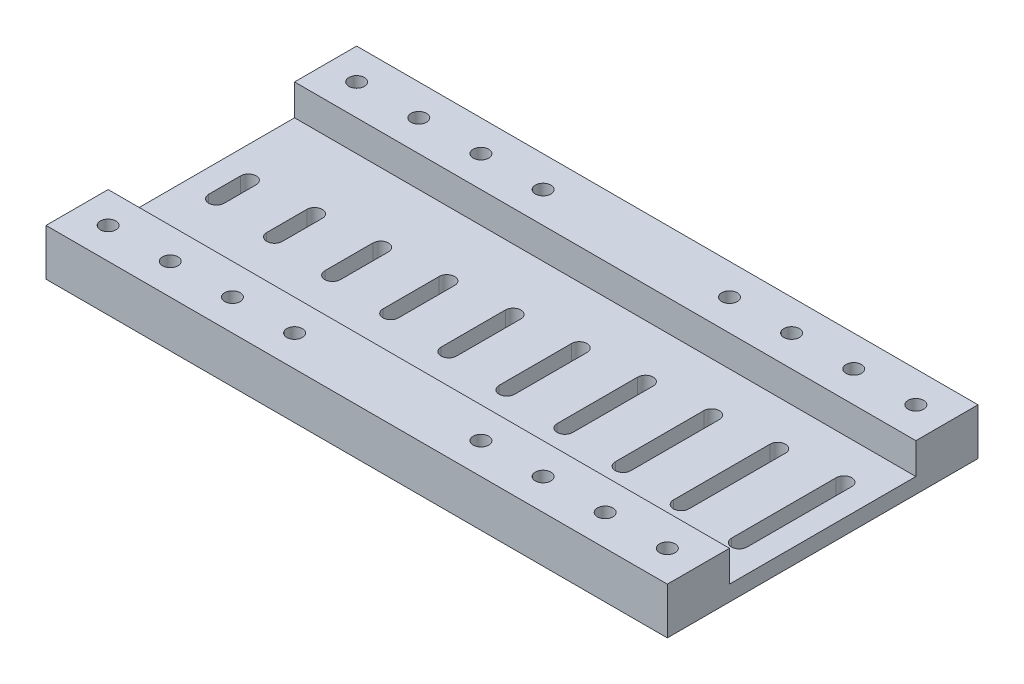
ISO-10303-21;
HEADER;
FILE_DESCRIPTION(('STEP AP214'),'2;1');
FILE_NAME('part.step','',(''),(''),'','','');
FILE_SCHEMA(('AUTOMOTIVE_DESIGN { 1 0 10303 214 1 1 1 1 }'));
ENDSEC;
DATA;
#1=APPLICATION_CONTEXT('core data for automotive mechanical design processes');
#2=APPLICATION_PROTOCOL_DEFINITION('international standard','automotive_design',2000,#1);
#3=PRODUCT_CONTEXT('',#1,'mechanical');
#4=PRODUCT('Part','Part','',(#3));
#5=PRODUCT_RELATED_PRODUCT_CATEGORY('part','',(#4));
#6=PRODUCT_DEFINITION_FORMATION('','',#4);
#7=PRODUCT_DEFINITION_CONTEXT('part definition',#1,'design');
#8=PRODUCT_DEFINITION('design','',#6,#7);
#9=PRODUCT_DEFINITION_SHAPE('','',#8);
#10=(LENGTH_UNIT() NAMED_UNIT(*) SI_UNIT(.MILLI.,.METRE.));
#11=(NAMED_UNIT(*) PLANE_ANGLE_UNIT() SI_UNIT($,.RADIAN.));
#12=(NAMED_UNIT(*) SI_UNIT($,.STERADIAN.) SOLID_ANGLE_UNIT());
#13=UNCERTAINTY_MEASURE_WITH_UNIT(LENGTH_MEASURE(1.E-05),#10,'distance_accuracy_value','');
#14=(GEOMETRIC_REPRESENTATION_CONTEXT(3) GLOBAL_UNCERTAINTY_ASSIGNED_CONTEXT((#13)) GLOBAL_UNIT_ASSIGNED_CONTEXT((#10,
#11,#12)) REPRESENTATION_CONTEXT('',''));
#15=CARTESIAN_POINT('',(0.,0.,0.));
#16=DIRECTION('',(0.,0.,1.));
#17=DIRECTION('',(1.,0.,0.));
#18=AXIS2_PLACEMENT_3D('',#15,#16,#17);
#19=CARTESIAN_POINT('',(0.,15.,0.));
#20=DIRECTION('',(0.,1.,0.));
#21=DIRECTION('',(0.,0.,1.));
#22=AXIS2_PLACEMENT_3D('',#19,#20,#21);
#23=PLANE('',#22);
#24=CARTESIAN_POINT('',(90.,15.,40.));
#25=DIRECTION('',(0.,1.,0.));
#26=DIRECTION('',(0.,0.,1.));
#27=AXIS2_PLACEMENT_3D('',#24,#25,#26);
#28=CIRCLE('',#27,2.49999999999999);
#29=CARTESIAN_POINT('',(90.,15.,42.5));
#30=VERTEX_POINT('',#29);
#31=EDGE_CURVE('E766',#30,#30,#28,.T.);
#32=ORIENTED_EDGE('',*,*,#31,.F.);
#33=EDGE_LOOP('',(#32));
#34=FACE_BOUND('',#33,.T.);
#35=CARTESIAN_POINT('',(70.,15.,40.));
#36=DIRECTION('',(0.,1.,0.));
#37=DIRECTION('',(0.,0.,1.));
#38=AXIS2_PLACEMENT_3D('',#35,#36,#37);
#39=CIRCLE('',#38,2.49999999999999);
#40=CARTESIAN_POINT('',(70.,15.,42.5));
#41=VERTEX_POINT('',#40);
#42=EDGE_CURVE('E772',#41,#41,#39,.T.);
#43=ORIENTED_EDGE('',*,*,#42,.F.);
#44=EDGE_LOOP('',(#43));
#45=FACE_BOUND('',#44,.T.);
#46=CARTESIAN_POINT('',(50.,15.,40.));
#47=DIRECTION('',(0.,1.,0.));
#48=DIRECTION('',(0.,0.,1.));
#49=AXIS2_PLACEMENT_3D('',#46,#47,#48);
#50=CIRCLE('',#49,2.49999999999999);
#51=CARTESIAN_POINT('',(50.,15.,42.5));
#52=VERTEX_POINT('',#51);
#53=EDGE_CURVE('E778',#52,#52,#50,.T.);
#54=ORIENTED_EDGE('',*,*,#53,.F.);
#55=EDGE_LOOP('',(#54));
#56=FACE_BOUND('',#55,.T.);
#57=CARTESIAN_POINT('',(30.,15.,40.));
#58=DIRECTION('',(0.,1.,0.));
#59=DIRECTION('',(0.,0.,1.));
#60=AXIS2_PLACEMENT_3D('',#57,#58,#59);
#61=CIRCLE('',#60,2.49999999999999);
#62=CARTESIAN_POINT('',(30.,15.,42.5));
#63=VERTEX_POINT('',#62);
#64=EDGE_CURVE('E784',#63,#63,#61,.T.);
#65=ORIENTED_EDGE('',*,*,#64,.F.);
#66=EDGE_LOOP('',(#65));
#67=FACE_BOUND('',#66,.T.);
#68=CARTESIAN_POINT('',(-30.,15.,40.));
#69=DIRECTION('',(0.,1.,0.));
#70=DIRECTION('',(0.,0.,1.));
#71=AXIS2_PLACEMENT_3D('',#68,#69,#70);
#72=CIRCLE('',#71,2.49999999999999);
#73=CARTESIAN_POINT('',(-30.,15.,42.5));
#74=VERTEX_POINT('',#73);
#75=EDGE_CURVE('E790',#74,#74,#72,.T.);
#76=ORIENTED_EDGE('',*,*,#75,.F.);
#77=EDGE_LOOP('',(#76));
#78=FACE_BOUND('',#77,.T.);
#79=CARTESIAN_POINT('',(-50.,15.,40.));
#80=DIRECTION('',(0.,1.,0.));
#81=DIRECTION('',(0.,0.,1.));
#82=AXIS2_PLACEMENT_3D('',#79,#80,#81);
#83=CIRCLE('',#82,2.49999999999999);
#84=CARTESIAN_POINT('',(-50.,15.,42.5));
#85=VERTEX_POINT('',#84);
#86=EDGE_CURVE('E796',#85,#85,#83,.T.);
#87=ORIENTED_EDGE('',*,*,#86,.F.);
#88=EDGE_LOOP('',(#87));
#89=FACE_BOUND('',#88,.T.);
#90=CARTESIAN_POINT('',(-70.,15.,40.));
#91=DIRECTION('',(0.,1.,0.));
#92=DIRECTION('',(0.,0.,1.));
#93=AXIS2_PLACEMENT_3D('',#90,#91,#92);
#94=CIRCLE('',#93,2.49999999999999);
#95=CARTESIAN_POINT('',(-70.,15.,42.5));
#96=VERTEX_POINT('',#95);
#97=EDGE_CURVE('E802',#96,#96,#94,.T.);
#98=ORIENTED_EDGE('',*,*,#97,.F.);
#99=EDGE_LOOP('',(#98));
#100=FACE_BOUND('',#99,.T.);
#101=CARTESIAN_POINT('',(-90.,15.,40.));
#102=DIRECTION('',(0.,1.,0.));
#103=DIRECTION('',(0.,0.,1.));
#104=AXIS2_PLACEMENT_3D('',#101,#102,#103);
#105=CIRCLE('',#104,2.49999999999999);
#106=CARTESIAN_POINT('',(-90.,15.,42.5));
#107=VERTEX_POINT('',#106);
#108=EDGE_CURVE('E808',#107,#107,#105,.T.);
#109=ORIENTED_EDGE('',*,*,#108,.F.);
#110=EDGE_LOOP('',(#109));
#111=FACE_BOUND('',#110,.T.);
#112=DIRECTION('',(1.,0.,0.));
#113=VECTOR('',#112,1.);
#114=CARTESIAN_POINT('',(-100.,15.,30.));
#115=LINE('',#114,#113);
#116=CARTESIAN_POINT('',(-100.,15.,30.));
#117=VERTEX_POINT('',#116);
#118=CARTESIAN_POINT('',(100.,15.,30.));
#119=VERTEX_POINT('',#118);
#120=EDGE_CURVE('E819',#117,#119,#115,.T.);
#121=ORIENTED_EDGE('',*,*,#120,.F.);
#122=DIRECTION('',(0.,0.,1.));
#123=VECTOR('',#122,1.);
#124=CARTESIAN_POINT('',(-100.,15.,-50.));
#125=LINE('',#124,#123);
#126=CARTESIAN_POINT('',(-100.,15.,50.));
#127=VERTEX_POINT('',#126);
#128=EDGE_CURVE('E846',#117,#127,#125,.T.);
#129=ORIENTED_EDGE('',*,*,#128,.T.);
#130=DIRECTION('',(1.,0.,0.));
#131=VECTOR('',#130,1.);
#132=CARTESIAN_POINT('',(-100.,15.,50.));
#133=LINE('',#132,#131);
#134=CARTESIAN_POINT('',(100.,15.,50.));
#135=VERTEX_POINT('',#134);
#136=EDGE_CURVE('E850',#127,#135,#133,.T.);
#137=ORIENTED_EDGE('',*,*,#136,.T.);
#138=DIRECTION('',(0.,0.,-1.));
#139=VECTOR('',#138,1.);
#140=CARTESIAN_POINT('',(100.,15.,-50.));
#141=LINE('',#140,#139);
#142=EDGE_CURVE('E840',#135,#119,#141,.T.);
#143=ORIENTED_EDGE('',*,*,#142,.T.);
#144=EDGE_LOOP('',(#121,#129,#137,#143));
#145=FACE_BOUND('',#144,.T.);
#146=ADVANCED_FACE('F39',(#34,#45,#56,#67,#78,#89,#100,#111,#145),#23,.T.);
#147=CARTESIAN_POINT('',(100.,15.,-50.));
#148=DIRECTION('',(-1.,0.,0.));
#149=DIRECTION('',(0.,0.,1.));
#150=AXIS2_PLACEMENT_3D('',#147,#148,#149);
#151=PLANE('',#150);
#152=DIRECTION('',(0.,0.,-1.));
#153=VECTOR('',#152,1.);
#154=CARTESIAN_POINT('',(100.,5.,-30.));
#155=LINE('',#154,#153);
#156=CARTESIAN_POINT('',(100.,5.,30.));
#157=VERTEX_POINT('',#156);
#158=CARTESIAN_POINT('',(100.,5.,-30.));
#159=VERTEX_POINT('',#158);
#160=EDGE_CURVE('E815',#157,#159,#155,.T.);
#161=ORIENTED_EDGE('',*,*,#160,.F.);
#162=DIRECTION('',(0.,1.,0.));
#163=VECTOR('',#162,1.);
#164=CARTESIAN_POINT('',(100.,5.,30.));
#165=LINE('',#164,#163);
#166=EDGE_CURVE('E830',#157,#119,#165,.T.);
#167=ORIENTED_EDGE('',*,*,#166,.T.);
#168=ORIENTED_EDGE('',*,*,#142,.F.);
#169=DIRECTION('',(0.,-1.,0.));
#170=VECTOR('',#169,1.);
#171=CARTESIAN_POINT('',(100.,15.,50.));
#172=LINE('',#171,#170);
#173=CARTESIAN_POINT('',(100.,0.,50.));
#174=VERTEX_POINT('',#173);
#175=EDGE_CURVE('E852',#135,#174,#172,.T.);
#176=ORIENTED_EDGE('',*,*,#175,.T.);
#177=DIRECTION('',(0.,0.,-1.));
#178=VECTOR('',#177,1.);
#179=CARTESIAN_POINT('',(100.,0.,-50.));
#180=LINE('',#179,#178);
#181=CARTESIAN_POINT('',(100.,0.,-50.));
#182=VERTEX_POINT('',#181);
#183=EDGE_CURVE('E833',#174,#182,#180,.T.);
#184=ORIENTED_EDGE('',*,*,#183,.T.);
#185=DIRECTION('',(0.,-1.,0.));
#186=VECTOR('',#185,1.);
#187=CARTESIAN_POINT('',(100.,15.,-50.));
#188=LINE('',#187,#186);
#189=CARTESIAN_POINT('',(100.,15.,-50.));
#190=VERTEX_POINT('',#189);
#191=EDGE_CURVE('E11',#190,#182,#188,.T.);
#192=ORIENTED_EDGE('',*,*,#191,.F.);
#193=CARTESIAN_POINT('',(100.,15.,-30.));
#194=VERTEX_POINT('',#193);
#195=EDGE_CURVE('E844',#194,#190,#141,.T.);
#196=ORIENTED_EDGE('',*,*,#195,.F.);
#197=DIRECTION('',(0.,1.,0.));
#198=VECTOR('',#197,1.);
#199=CARTESIAN_POINT('',(100.,5.,-30.));
#200=LINE('',#199,#198);
#201=EDGE_CURVE('E827',#159,#194,#200,.T.);
#202=ORIENTED_EDGE('',*,*,#201,.F.);
#203=EDGE_LOOP('',(#161,#167,#168,#176,#184,#192,#196,#202));
#204=FACE_BOUND('',#203,.T.);
#205=ADVANCED_FACE('F41',(#204),#151,.F.);
#206=CARTESIAN_POINT('',(-100.,15.,-50.));
#207=DIRECTION('',(0.,0.,1.));
#208=DIRECTION('',(1.,0.,0.));
#209=AXIS2_PLACEMENT_3D('',#206,#207,#208);
#210=PLANE('',#209);
#211=DIRECTION('',(-1.,0.,0.));
#212=VECTOR('',#211,1.);
#213=CARTESIAN_POINT('',(-100.,0.,-50.));
#214=LINE('',#213,#212);
#215=CARTESIAN_POINT('',(-100.,0.,-50.));
#216=VERTEX_POINT('',#215);
#217=EDGE_CURVE('E855',#182,#216,#214,.T.);
#218=ORIENTED_EDGE('',*,*,#217,.T.);
#219=DIRECTION('',(0.,-1.,0.));
#220=VECTOR('',#219,1.);
#221=CARTESIAN_POINT('',(-100.,15.,-50.));
#222=LINE('',#221,#220);
#223=CARTESIAN_POINT('',(-100.,15.,-50.));
#224=VERTEX_POINT('',#223);
#225=EDGE_CURVE('E47',#224,#216,#222,.T.);
#226=ORIENTED_EDGE('',*,*,#225,.F.);
#227=DIRECTION('',(-1.,0.,0.));
#228=VECTOR('',#227,1.);
#229=CARTESIAN_POINT('',(-100.,15.,-50.));
#230=LINE('',#229,#228);
#231=EDGE_CURVE('E843',#190,#224,#230,.T.);
#232=ORIENTED_EDGE('',*,*,#231,.F.);
#233=ORIENTED_EDGE('',*,*,#191,.T.);
#234=EDGE_LOOP('',(#218,#226,#232,#233));
#235=FACE_BOUND('',#234,.T.);
#236=ADVANCED_FACE('F902',(#235),#210,.F.);
#237=CARTESIAN_POINT('',(-100.,15.,-50.));
#238=DIRECTION('',(1.,0.,0.));
#239=DIRECTION('',(0.,0.,-1.));
#240=AXIS2_PLACEMENT_3D('',#237,#238,#239);
#241=PLANE('',#240);
#242=ORIENTED_EDGE('',*,*,#128,.F.);
#243=DIRECTION('',(0.,1.,0.));
#244=VECTOR('',#243,1.);
#245=CARTESIAN_POINT('',(-100.,5.,30.));
#246=LINE('',#245,#244);
#247=CARTESIAN_POINT('',(-100.,5.,30.));
#248=VERTEX_POINT('',#247);
#249=EDGE_CURVE('E834',#248,#117,#246,.T.);
#250=ORIENTED_EDGE('',*,*,#249,.F.);
#251=DIRECTION('',(0.,0.,1.));
#252=VECTOR('',#251,1.);
#253=CARTESIAN_POINT('',(-100.,5.,-30.));
#254=LINE('',#253,#252);
#255=CARTESIAN_POINT('',(-100.,5.,-30.));
#256=VERTEX_POINT('',#255);
#257=EDGE_CURVE('E822',#256,#248,#254,.T.);
#258=ORIENTED_EDGE('',*,*,#257,.F.);
#259=DIRECTION('',(0.,1.,0.));
#260=VECTOR('',#259,1.);
#261=CARTESIAN_POINT('',(-100.,5.,-30.));
#262=LINE('',#261,#260);
#263=CARTESIAN_POINT('',(-100.,15.,-30.));
#264=VERTEX_POINT('',#263);
#265=EDGE_CURVE('E836',#256,#264,#262,.T.);
#266=ORIENTED_EDGE('',*,*,#265,.T.);
#267=EDGE_CURVE('E847',#224,#264,#125,.T.);
#268=ORIENTED_EDGE('',*,*,#267,.F.);
#269=ORIENTED_EDGE('',*,*,#225,.T.);
#270=DIRECTION('',(0.,0.,1.));
#271=VECTOR('',#270,1.);
#272=CARTESIAN_POINT('',(-100.,0.,-50.));
#273=LINE('',#272,#271);
#274=CARTESIAN_POINT('',(-100.,0.,50.));
#275=VERTEX_POINT('',#274);
#276=EDGE_CURVE('E857',#216,#275,#273,.T.);
#277=ORIENTED_EDGE('',*,*,#276,.T.);
#278=DIRECTION('',(0.,-1.,0.));
#279=VECTOR('',#278,1.);
#280=CARTESIAN_POINT('',(-100.,15.,50.));
#281=LINE('',#280,#279);
#282=EDGE_CURVE('E863',#127,#275,#281,.T.);
#283=ORIENTED_EDGE('',*,*,#282,.F.);
#284=EDGE_LOOP('',(#242,#250,#258,#266,#268,#269,#277,#283));
#285=FACE_BOUND('',#284,.T.);
#286=ADVANCED_FACE('F871',(#285),#241,.F.);
#287=CARTESIAN_POINT('',(-100.,15.,50.));
#288=DIRECTION('',(0.,0.,-1.));
#289=DIRECTION('',(-1.,0.,0.));
#290=AXIS2_PLACEMENT_3D('',#287,#288,#289);
#291=PLANE('',#290);
#292=DIRECTION('',(1.,0.,0.));
#293=VECTOR('',#292,1.);
#294=CARTESIAN_POINT('',(-100.,0.,50.));
#295=LINE('',#294,#293);
#296=EDGE_CURVE('E859',#275,#174,#295,.T.);
#297=ORIENTED_EDGE('',*,*,#296,.T.);
#298=ORIENTED_EDGE('',*,*,#175,.F.);
#299=ORIENTED_EDGE('',*,*,#136,.F.);
#300=ORIENTED_EDGE('',*,*,#282,.T.);
#301=EDGE_LOOP('',(#297,#298,#299,#300));
#302=FACE_BOUND('',#301,.T.);
#303=ADVANCED_FACE('F880',(#302),#291,.F.);
#304=CARTESIAN_POINT('',(90.,15.,-40.));
#305=DIRECTION('',(0.,1.,0.));
#306=DIRECTION('',(0.,0.,1.));
#307=AXIS2_PLACEMENT_3D('',#304,#305,#306);
#308=CIRCLE('',#307,2.49999999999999);
#309=CARTESIAN_POINT('',(90.,15.,-37.5));
#310=VERTEX_POINT('',#309);
#311=EDGE_CURVE('E712',#310,#310,#308,.T.);
#312=ORIENTED_EDGE('',*,*,#311,.F.);
#313=EDGE_LOOP('',(#312));
#314=FACE_BOUND('',#313,.T.);
#315=CARTESIAN_POINT('',(70.,15.,-40.));
#316=DIRECTION('',(0.,1.,0.));
#317=DIRECTION('',(0.,0.,1.));
#318=AXIS2_PLACEMENT_3D('',#315,#316,#317);
#319=CIRCLE('',#318,2.49999999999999);
#320=CARTESIAN_POINT('',(70.,15.,-37.5));
#321=VERTEX_POINT('',#320);
#322=EDGE_CURVE('E724',#321,#321,#319,.T.);
#323=ORIENTED_EDGE('',*,*,#322,.F.);
#324=EDGE_LOOP('',(#323));
#325=FACE_BOUND('',#324,.T.);
#326=CARTESIAN_POINT('',(50.,15.,-40.));
#327=DIRECTION('',(0.,1.,0.));
#328=DIRECTION('',(0.,0.,1.));
#329=AXIS2_PLACEMENT_3D('',#326,#327,#328);
#330=CIRCLE('',#329,2.49999999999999);
#331=CARTESIAN_POINT('',(50.,15.,-37.5));
#332=VERTEX_POINT('',#331);
#333=EDGE_CURVE('E730',#332,#332,#330,.T.);
#334=ORIENTED_EDGE('',*,*,#333,.F.);
#335=EDGE_LOOP('',(#334));
#336=FACE_BOUND('',#335,.T.);
#337=CARTESIAN_POINT('',(30.,15.,-40.));
#338=DIRECTION('',(0.,1.,0.));
#339=DIRECTION('',(0.,0.,1.));
#340=AXIS2_PLACEMENT_3D('',#337,#338,#339);
#341=CIRCLE('',#340,2.49999999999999);
#342=CARTESIAN_POINT('',(30.,15.,-37.5));
#343=VERTEX_POINT('',#342);
#344=EDGE_CURVE('E736',#343,#343,#341,.T.);
#345=ORIENTED_EDGE('',*,*,#344,.F.);
#346=EDGE_LOOP('',(#345));
#347=FACE_BOUND('',#346,.T.);
#348=CARTESIAN_POINT('',(-30.,15.,-40.));
#349=DIRECTION('',(0.,1.,0.));
#350=DIRECTION('',(0.,0.,1.));
#351=AXIS2_PLACEMENT_3D('',#348,#349,#350);
#352=CIRCLE('',#351,2.49999999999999);
#353=CARTESIAN_POINT('',(-30.,15.,-37.5));
#354=VERTEX_POINT('',#353);
#355=EDGE_CURVE('E742',#354,#354,#352,.T.);
#356=ORIENTED_EDGE('',*,*,#355,.F.);
#357=EDGE_LOOP('',(#356));
#358=FACE_BOUND('',#357,.T.);
#359=CARTESIAN_POINT('',(-50.,15.,-40.));
#360=DIRECTION('',(0.,1.,0.));
#361=DIRECTION('',(0.,0.,1.));
#362=AXIS2_PLACEMENT_3D('',#359,#360,#361);
#363=CIRCLE('',#362,2.49999999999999);
#364=CARTESIAN_POINT('',(-50.,15.,-37.5));
#365=VERTEX_POINT('',#364);
#366=EDGE_CURVE('E748',#365,#365,#363,.T.);
#367=ORIENTED_EDGE('',*,*,#366,.F.);
#368=EDGE_LOOP('',(#367));
#369=FACE_BOUND('',#368,.T.);
#370=CARTESIAN_POINT('',(-70.,15.,-40.));
#371=DIRECTION('',(0.,1.,0.));
#372=DIRECTION('',(0.,0.,1.));
#373=AXIS2_PLACEMENT_3D('',#370,#371,#372);
#374=CIRCLE('',#373,2.49999999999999);
#375=CARTESIAN_POINT('',(-70.,15.,-37.5));
#376=VERTEX_POINT('',#375);
#377=EDGE_CURVE('E754',#376,#376,#374,.T.);
#378=ORIENTED_EDGE('',*,*,#377,.F.);
#379=EDGE_LOOP('',(#378));
#380=FACE_BOUND('',#379,.T.);
#381=CARTESIAN_POINT('',(-90.,15.,-40.));
#382=DIRECTION('',(0.,1.,0.));
#383=DIRECTION('',(0.,0.,1.));
#384=AXIS2_PLACEMENT_3D('',#381,#382,#383);
#385=CIRCLE('',#384,2.49999999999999);
#386=CARTESIAN_POINT('',(-90.,15.,-37.5));
#387=VERTEX_POINT('',#386);
#388=EDGE_CURVE('E760',#387,#387,#385,.T.);
#389=ORIENTED_EDGE('',*,*,#388,.F.);
#390=EDGE_LOOP('',(#389));
#391=FACE_BOUND('',#390,.T.);
#392=DIRECTION('',(-1.,0.,0.));
#393=VECTOR('',#392,1.);
#394=CARTESIAN_POINT('',(-100.,15.,-30.));
#395=LINE('',#394,#393);
#396=EDGE_CURVE('E814',#194,#264,#395,.T.);
#397=ORIENTED_EDGE('',*,*,#396,.F.);
#398=ORIENTED_EDGE('',*,*,#195,.T.);
#399=ORIENTED_EDGE('',*,*,#231,.T.);
#400=ORIENTED_EDGE('',*,*,#267,.T.);
#401=EDGE_LOOP('',(#397,#398,#399,#400));
#402=FACE_BOUND('',#401,.T.);
#403=ADVANCED_FACE('F901',(#314,#325,#336,#347,#358,#369,#380,#391,#402),#23,.T.);
#404=CARTESIAN_POINT('',(0.,0.,0.));
#405=DIRECTION('',(0.,1.,0.));
#406=DIRECTION('',(0.,0.,1.));
#407=AXIS2_PLACEMENT_3D('',#404,#405,#406);
#408=PLANE('',#407);
#409=DIRECTION('',(0.,0.,-1.));
#410=VECTOR('',#409,1.);
#411=CARTESIAN_POINT('',(-67.5,0.,-6.44472431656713));
#412=LINE('',#411,#410);
#413=CARTESIAN_POINT('',(-67.4999999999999,0.,6.44472431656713));
#414=VERTEX_POINT('',#413);
#415=CARTESIAN_POINT('',(-67.5,0.,-6.44472431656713));
#416=VERTEX_POINT('',#415);
#417=EDGE_CURVE('E404',#414,#416,#412,.T.);
#418=ORIENTED_EDGE('',*,*,#417,.T.);
#419=CARTESIAN_POINT('',(-70.,0.,-6.44472431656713));
#420=DIRECTION('',(0.,1.,0.));
#421=DIRECTION('',(0.,0.,1.));
#422=AXIS2_PLACEMENT_3D('',#419,#420,#421);
#423=CIRCLE('',#422,2.5);
#424=CARTESIAN_POINT('',(-72.5,0.,-6.44472431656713));
#425=VERTEX_POINT('',#424);
#426=EDGE_CURVE('E396',#416,#425,#423,.T.);
#427=ORIENTED_EDGE('',*,*,#426,.T.);
#428=DIRECTION('',(0.,0.,1.));
#429=VECTOR('',#428,1.);
#430=CARTESIAN_POINT('',(-72.5,0.,-6.44472431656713));
#431=LINE('',#430,#429);
#432=CARTESIAN_POINT('',(-72.5,0.,6.44472431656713));
#433=VERTEX_POINT('',#432);
#434=EDGE_CURVE('E407',#425,#433,#431,.T.);
#435=ORIENTED_EDGE('',*,*,#434,.T.);
#436=CARTESIAN_POINT('',(-70.,0.,6.44472431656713));
#437=DIRECTION('',(0.,1.,0.));
#438=DIRECTION('',(0.,0.,1.));
#439=AXIS2_PLACEMENT_3D('',#436,#437,#438);
#440=CIRCLE('',#439,2.50000000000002);
#441=EDGE_CURVE('E54',#433,#414,#440,.T.);
#442=ORIENTED_EDGE('',*,*,#441,.T.);
#443=EDGE_LOOP('',(#418,#427,#435,#442));
#444=FACE_BOUND('',#443,.T.);
#445=DIRECTION('',(0.,0.,-1.));
#446=VECTOR('',#445,1.);
#447=CARTESIAN_POINT('',(-47.5,0.,-7.74472431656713));
#448=LINE('',#447,#446);
#449=CARTESIAN_POINT('',(-47.5,0.,7.74472431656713));
#450=VERTEX_POINT('',#449);
#451=CARTESIAN_POINT('',(-47.5,0.,-7.74472431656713));
#452=VERTEX_POINT('',#451);
#453=EDGE_CURVE('E442',#450,#452,#448,.T.);
#454=ORIENTED_EDGE('',*,*,#453,.T.);
#455=CARTESIAN_POINT('',(-50.,0.,-7.74472431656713));
#456=DIRECTION('',(0.,1.,0.));
#457=DIRECTION('',(0.,0.,1.));
#458=AXIS2_PLACEMENT_3D('',#455,#456,#457);
#459=CIRCLE('',#458,2.5);
#460=CARTESIAN_POINT('',(-52.5,0.,-7.74472431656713));
#461=VERTEX_POINT('',#460);
#462=EDGE_CURVE('E434',#452,#461,#459,.T.);
#463=ORIENTED_EDGE('',*,*,#462,.T.);
#464=DIRECTION('',(0.,0.,1.));
#465=VECTOR('',#464,1.);
#466=CARTESIAN_POINT('',(-52.5,0.,-7.74472431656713));
#467=LINE('',#466,#465);
#468=CARTESIAN_POINT('',(-52.5,0.,7.74472431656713));
#469=VERTEX_POINT('',#468);
#470=EDGE_CURVE('E437',#461,#469,#467,.T.);
#471=ORIENTED_EDGE('',*,*,#470,.T.);
#472=CARTESIAN_POINT('',(-50.,0.,7.74472431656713));
#473=DIRECTION('',(0.,1.,0.));
#474=DIRECTION('',(0.,0.,1.));
#475=AXIS2_PLACEMENT_3D('',#472,#473,#474);
#476=CIRCLE('',#475,2.5);
#477=EDGE_CURVE('E62',#469,#450,#476,.T.);
#478=ORIENTED_EDGE('',*,*,#477,.T.);
#479=EDGE_LOOP('',(#454,#463,#471,#478));
#480=FACE_BOUND('',#479,.T.);
#481=DIRECTION('',(0.,0.,-1.));
#482=VECTOR('',#481,1.);
#483=CARTESIAN_POINT('',(-27.5,0.,-9.04472431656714));
#484=LINE('',#483,#482);
#485=CARTESIAN_POINT('',(-27.5,0.,9.04472431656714));
#486=VERTEX_POINT('',#485);
#487=CARTESIAN_POINT('',(-27.5,0.,-9.04472431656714));
#488=VERTEX_POINT('',#487);
#489=EDGE_CURVE('E474',#486,#488,#484,.T.);
#490=ORIENTED_EDGE('',*,*,#489,.T.);
#491=CARTESIAN_POINT('',(-30.,0.,-9.04472431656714));
#492=DIRECTION('',(0.,1.,0.));
#493=DIRECTION('',(0.,0.,1.));
#494=AXIS2_PLACEMENT_3D('',#491,#492,#493);
#495=CIRCLE('',#494,2.5);
#496=CARTESIAN_POINT('',(-32.5,0.,-9.04472431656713));
#497=VERTEX_POINT('',#496);
#498=EDGE_CURVE('E464',#488,#497,#495,.T.);
#499=ORIENTED_EDGE('',*,*,#498,.T.);
#500=DIRECTION('',(0.,0.,1.));
#501=VECTOR('',#500,1.);
#502=CARTESIAN_POINT('',(-32.5,0.,-9.04472431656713));
#503=LINE('',#502,#501);
#504=CARTESIAN_POINT('',(-32.5,0.,9.04472431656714));
#505=VERTEX_POINT('',#504);
#506=EDGE_CURVE('E467',#497,#505,#503,.T.);
#507=ORIENTED_EDGE('',*,*,#506,.T.);
#508=CARTESIAN_POINT('',(-30.,0.,9.04472431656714));
#509=DIRECTION('',(0.,1.,0.));
#510=DIRECTION('',(0.,0.,1.));
#511=AXIS2_PLACEMENT_3D('',#508,#509,#510);
#512=CIRCLE('',#511,2.5);
#513=EDGE_CURVE('E471',#505,#486,#512,.T.);
#514=ORIENTED_EDGE('',*,*,#513,.T.);
#515=EDGE_LOOP('',(#490,#499,#507,#514));
#516=FACE_BOUND('',#515,.T.);
#517=DIRECTION('',(0.,0.,-1.));
#518=VECTOR('',#517,1.);
#519=CARTESIAN_POINT('',(-7.49999999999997,0.,-10.3447243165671));
#520=LINE('',#519,#518);
#521=CARTESIAN_POINT('',(-7.49999999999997,0.,10.3447243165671));
#522=VERTEX_POINT('',#521);
#523=CARTESIAN_POINT('',(-7.49999999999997,0.,-10.3447243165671));
#524=VERTEX_POINT('',#523);
#525=EDGE_CURVE('E506',#522,#524,#520,.T.);
#526=ORIENTED_EDGE('',*,*,#525,.T.);
#527=CARTESIAN_POINT('',(-9.99999999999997,0.,-10.3447243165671));
#528=DIRECTION('',(0.,1.,0.));
#529=DIRECTION('',(0.,0.,1.));
#530=AXIS2_PLACEMENT_3D('',#527,#528,#529);
#531=CIRCLE('',#530,2.5);
#532=CARTESIAN_POINT('',(-12.5,0.,-10.3447243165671));
#533=VERTEX_POINT('',#532);
#534=EDGE_CURVE('E496',#524,#533,#531,.T.);
#535=ORIENTED_EDGE('',*,*,#534,.T.);
#536=DIRECTION('',(0.,0.,1.));
#537=VECTOR('',#536,1.);
#538=CARTESIAN_POINT('',(-12.5,0.,-10.3447243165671));
#539=LINE('',#538,#537);
#540=CARTESIAN_POINT('',(-12.5,0.,10.3447243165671));
#541=VERTEX_POINT('',#540);
#542=EDGE_CURVE('E499',#533,#541,#539,.T.);
#543=ORIENTED_EDGE('',*,*,#542,.T.);
#544=CARTESIAN_POINT('',(-9.99999999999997,0.,10.3447243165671));
#545=DIRECTION('',(0.,1.,0.));
#546=DIRECTION('',(0.,0.,1.));
#547=AXIS2_PLACEMENT_3D('',#544,#545,#546);
#548=CIRCLE('',#547,2.5);
#549=EDGE_CURVE('E503',#541,#522,#548,.T.);
#550=ORIENTED_EDGE('',*,*,#549,.T.);
#551=EDGE_LOOP('',(#526,#535,#543,#550));
#552=FACE_BOUND('',#551,.T.);
#553=DIRECTION('',(0.,0.,-1.));
#554=VECTOR('',#553,1.);
#555=CARTESIAN_POINT('',(12.5,0.,-11.6447243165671));
#556=LINE('',#555,#554);
#557=CARTESIAN_POINT('',(12.5,0.,11.6447243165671));
#558=VERTEX_POINT('',#557);
#559=CARTESIAN_POINT('',(12.5,0.,-11.6447243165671));
#560=VERTEX_POINT('',#559);
#561=EDGE_CURVE('E538',#558,#560,#556,.T.);
#562=ORIENTED_EDGE('',*,*,#561,.T.);
#563=CARTESIAN_POINT('',(10.,0.,-11.6447243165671));
#564=DIRECTION('',(0.,1.,0.));
#565=DIRECTION('',(0.,0.,1.));
#566=AXIS2_PLACEMENT_3D('',#563,#564,#565);
#567=CIRCLE('',#566,2.5);
#568=CARTESIAN_POINT('',(7.50000000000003,0.,-11.6447243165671));
#569=VERTEX_POINT('',#568);
#570=EDGE_CURVE('E528',#560,#569,#567,.T.);
#571=ORIENTED_EDGE('',*,*,#570,.T.);
#572=DIRECTION('',(0.,0.,1.));
#573=VECTOR('',#572,1.);
#574=CARTESIAN_POINT('',(7.50000000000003,0.,-11.6447243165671));
#575=LINE('',#574,#573);
#576=CARTESIAN_POINT('',(7.50000000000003,0.,11.6447243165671));
#577=VERTEX_POINT('',#576);
#578=EDGE_CURVE('E531',#569,#577,#575,.T.);
#579=ORIENTED_EDGE('',*,*,#578,.T.);
#580=CARTESIAN_POINT('',(10.,0.,11.6447243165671));
#581=DIRECTION('',(0.,1.,0.));
#582=DIRECTION('',(0.,0.,1.));
#583=AXIS2_PLACEMENT_3D('',#580,#581,#582);
#584=CIRCLE('',#583,2.5);
#585=EDGE_CURVE('E535',#577,#558,#584,.T.);
#586=ORIENTED_EDGE('',*,*,#585,.T.);
#587=EDGE_LOOP('',(#562,#571,#579,#586));
#588=FACE_BOUND('',#587,.T.);
#589=DIRECTION('',(0.,0.,-1.));
#590=VECTOR('',#589,1.);
#591=CARTESIAN_POINT('',(32.5,0.,-12.9447243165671));
#592=LINE('',#591,#590);
#593=CARTESIAN_POINT('',(32.5,0.,12.9447243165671));
#594=VERTEX_POINT('',#593);
#595=CARTESIAN_POINT('',(32.5,0.,-12.9447243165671));
#596=VERTEX_POINT('',#595);
#597=EDGE_CURVE('E570',#594,#596,#592,.T.);
#598=ORIENTED_EDGE('',*,*,#597,.T.);
#599=CARTESIAN_POINT('',(30.,0.,-12.9447243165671));
#600=DIRECTION('',(0.,1.,0.));
#601=DIRECTION('',(0.,0.,1.));
#602=AXIS2_PLACEMENT_3D('',#599,#600,#601);
#603=CIRCLE('',#602,2.5);
#604=CARTESIAN_POINT('',(27.5,0.,-12.9447243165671));
#605=VERTEX_POINT('',#604);
#606=EDGE_CURVE('E560',#596,#605,#603,.T.);
#607=ORIENTED_EDGE('',*,*,#606,.T.);
#608=DIRECTION('',(0.,0.,1.));
#609=VECTOR('',#608,1.);
#610=CARTESIAN_POINT('',(27.5,0.,-12.9447243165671));
#611=LINE('',#610,#609);
#612=CARTESIAN_POINT('',(27.5,0.,12.9447243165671));
#613=VERTEX_POINT('',#612);
#614=EDGE_CURVE('E563',#605,#613,#611,.T.);
#615=ORIENTED_EDGE('',*,*,#614,.T.);
#616=CARTESIAN_POINT('',(30.,0.,12.9447243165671));
#617=DIRECTION('',(0.,1.,0.));
#618=DIRECTION('',(0.,0.,1.));
#619=AXIS2_PLACEMENT_3D('',#616,#617,#618);
#620=CIRCLE('',#619,2.5);
#621=EDGE_CURVE('E567',#613,#594,#620,.T.);
#622=ORIENTED_EDGE('',*,*,#621,.T.);
#623=EDGE_LOOP('',(#598,#607,#615,#622));
#624=FACE_BOUND('',#623,.T.);
#625=DIRECTION('',(0.,0.,-1.));
#626=VECTOR('',#625,1.);
#627=CARTESIAN_POINT('',(52.5000000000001,0.,-14.2447243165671));
#628=LINE('',#627,#626);
#629=CARTESIAN_POINT('',(52.5000000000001,0.,14.2447243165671));
#630=VERTEX_POINT('',#629);
#631=CARTESIAN_POINT('',(52.5000000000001,0.,-14.2447243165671));
#632=VERTEX_POINT('',#631);
#633=EDGE_CURVE('E602',#630,#632,#628,.T.);
#634=ORIENTED_EDGE('',*,*,#633,.T.);
#635=CARTESIAN_POINT('',(50.0000000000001,0.,-14.2447243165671));
#636=DIRECTION('',(0.,1.,0.));
#637=DIRECTION('',(0.,0.,1.));
#638=AXIS2_PLACEMENT_3D('',#635,#636,#637);
#639=CIRCLE('',#638,2.5);
#640=CARTESIAN_POINT('',(47.5000000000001,0.,-14.2447243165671));
#641=VERTEX_POINT('',#640);
#642=EDGE_CURVE('E592',#632,#641,#639,.T.);
#643=ORIENTED_EDGE('',*,*,#642,.T.);
#644=DIRECTION('',(0.,0.,1.));
#645=VECTOR('',#644,1.);
#646=CARTESIAN_POINT('',(47.5000000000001,0.,-14.2447243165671));
#647=LINE('',#646,#645);
#648=CARTESIAN_POINT('',(47.5000000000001,0.,14.2447243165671));
#649=VERTEX_POINT('',#648);
#650=EDGE_CURVE('E595',#641,#649,#647,.T.);
#651=ORIENTED_EDGE('',*,*,#650,.T.);
#652=CARTESIAN_POINT('',(50.0000000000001,0.,14.2447243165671));
#653=DIRECTION('',(0.,1.,0.));
#654=DIRECTION('',(0.,0.,1.));
#655=AXIS2_PLACEMENT_3D('',#652,#653,#654);
#656=CIRCLE('',#655,2.5);
#657=EDGE_CURVE('E599',#649,#630,#656,.T.);
#658=ORIENTED_EDGE('',*,*,#657,.T.);
#659=EDGE_LOOP('',(#634,#643,#651,#658));
#660=FACE_BOUND('',#659,.T.);
#661=DIRECTION('',(0.,0.,-1.));
#662=VECTOR('',#661,1.);
#663=CARTESIAN_POINT('',(72.5000000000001,0.,-15.5447243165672));
#664=LINE('',#663,#662);
#665=CARTESIAN_POINT('',(72.5000000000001,0.,15.5447243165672));
#666=VERTEX_POINT('',#665);
#667=CARTESIAN_POINT('',(72.5000000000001,0.,-15.5447243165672));
#668=VERTEX_POINT('',#667);
#669=EDGE_CURVE('E634',#666,#668,#664,.T.);
#670=ORIENTED_EDGE('',*,*,#669,.T.);
#671=CARTESIAN_POINT('',(70.,0.,-15.5447243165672));
#672=DIRECTION('',(0.,1.,0.));
#673=DIRECTION('',(0.,0.,1.));
#674=AXIS2_PLACEMENT_3D('',#671,#672,#673);
#675=CIRCLE('',#674,2.5);
#676=CARTESIAN_POINT('',(67.5,0.,-15.5447243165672));
#677=VERTEX_POINT('',#676);
#678=EDGE_CURVE('E624',#668,#677,#675,.T.);
#679=ORIENTED_EDGE('',*,*,#678,.T.);
#680=DIRECTION('',(0.,0.,1.));
#681=VECTOR('',#680,1.);
#682=CARTESIAN_POINT('',(67.5,0.,-15.5447243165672));
#683=LINE('',#682,#681);
#684=CARTESIAN_POINT('',(67.5000000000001,0.,15.5447243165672));
#685=VERTEX_POINT('',#684);
#686=EDGE_CURVE('E627',#677,#685,#683,.T.);
#687=ORIENTED_EDGE('',*,*,#686,.T.);
#688=CARTESIAN_POINT('',(70.,0.,15.5447243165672));
#689=DIRECTION('',(0.,1.,0.));
#690=DIRECTION('',(0.,0.,1.));
#691=AXIS2_PLACEMENT_3D('',#688,#689,#690);
#692=CIRCLE('',#691,2.5);
#693=EDGE_CURVE('E631',#685,#666,#692,.T.);
#694=ORIENTED_EDGE('',*,*,#693,.T.);
#695=EDGE_LOOP('',(#670,#679,#687,#694));
#696=FACE_BOUND('',#695,.T.);
#697=DIRECTION('',(0.,0.,-1.));
#698=VECTOR('',#697,1.);
#699=CARTESIAN_POINT('',(92.5,0.,-16.8447243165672));
#700=LINE('',#699,#698);
#701=CARTESIAN_POINT('',(92.5,0.,16.8447243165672));
#702=VERTEX_POINT('',#701);
#703=CARTESIAN_POINT('',(92.5,0.,-16.8447243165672));
#704=VERTEX_POINT('',#703);
#705=EDGE_CURVE('E666',#702,#704,#700,.T.);
#706=ORIENTED_EDGE('',*,*,#705,.T.);
#707=CARTESIAN_POINT('',(90.,0.,-16.8447243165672));
#708=DIRECTION('',(0.,1.,0.));
#709=DIRECTION('',(0.,0.,1.));
#710=AXIS2_PLACEMENT_3D('',#707,#708,#709);
#711=CIRCLE('',#710,2.5);
#712=CARTESIAN_POINT('',(87.5,0.,-16.8447243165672));
#713=VERTEX_POINT('',#712);
#714=EDGE_CURVE('E656',#704,#713,#711,.T.);
#715=ORIENTED_EDGE('',*,*,#714,.T.);
#716=DIRECTION('',(0.,0.,1.));
#717=VECTOR('',#716,1.);
#718=CARTESIAN_POINT('',(87.5,0.,-16.8447243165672));
#719=LINE('',#718,#717);
#720=CARTESIAN_POINT('',(87.5000000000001,0.,16.8447243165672));
#721=VERTEX_POINT('',#720);
#722=EDGE_CURVE('E659',#713,#721,#719,.T.);
#723=ORIENTED_EDGE('',*,*,#722,.T.);
#724=CARTESIAN_POINT('',(90.,0.,16.8447243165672));
#725=DIRECTION('',(0.,1.,0.));
#726=DIRECTION('',(0.,0.,1.));
#727=AXIS2_PLACEMENT_3D('',#724,#725,#726);
#728=CIRCLE('',#727,2.5);
#729=EDGE_CURVE('E663',#721,#702,#728,.T.);
#730=ORIENTED_EDGE('',*,*,#729,.T.);
#731=EDGE_LOOP('',(#706,#715,#723,#730));
#732=FACE_BOUND('',#731,.T.);
#733=DIRECTION('',(0.,0.,-1.));
#734=VECTOR('',#733,1.);
#735=CARTESIAN_POINT('',(-87.5,0.,-5.14472431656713));
#736=LINE('',#735,#734);
#737=CARTESIAN_POINT('',(-87.5,0.,5.14472431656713));
#738=VERTEX_POINT('',#737);
#739=CARTESIAN_POINT('',(-87.5,0.,-5.14472431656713));
#740=VERTEX_POINT('',#739);
#741=EDGE_CURVE('E697',#738,#740,#736,.T.);
#742=ORIENTED_EDGE('',*,*,#741,.T.);
#743=CARTESIAN_POINT('',(-90.,0.,-5.14472431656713));
#744=DIRECTION('',(0.,1.,0.));
#745=DIRECTION('',(0.,0.,1.));
#746=AXIS2_PLACEMENT_3D('',#743,#744,#745);
#747=CIRCLE('',#746,2.5);
#748=CARTESIAN_POINT('',(-92.5,0.,-5.14472431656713));
#749=VERTEX_POINT('',#748);
#750=EDGE_CURVE('E687',#740,#749,#747,.T.);
#751=ORIENTED_EDGE('',*,*,#750,.T.);
#752=DIRECTION('',(0.,0.,1.));
#753=VECTOR('',#752,1.);
#754=CARTESIAN_POINT('',(-92.5,0.,-5.14472431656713));
#755=LINE('',#754,#753);
#756=CARTESIAN_POINT('',(-92.5,0.,5.14472431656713));
#757=VERTEX_POINT('',#756);
#758=EDGE_CURVE('E690',#749,#757,#755,.T.);
#759=ORIENTED_EDGE('',*,*,#758,.T.);
#760=CARTESIAN_POINT('',(-90.,0.,5.14472431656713));
#761=DIRECTION('',(0.,1.,0.));
#762=DIRECTION('',(0.,0.,1.));
#763=AXIS2_PLACEMENT_3D('',#760,#761,#762);
#764=CIRCLE('',#763,2.5);
#765=EDGE_CURVE('E694',#757,#738,#764,.T.);
#766=ORIENTED_EDGE('',*,*,#765,.T.);
#767=EDGE_LOOP('',(#742,#751,#759,#766));
#768=FACE_BOUND('',#767,.T.);
#769=ORIENTED_EDGE('',*,*,#183,.F.);
#770=ORIENTED_EDGE('',*,*,#296,.F.);
#771=ORIENTED_EDGE('',*,*,#276,.F.);
#772=ORIENTED_EDGE('',*,*,#217,.F.);
#773=EDGE_LOOP('',(#769,#770,#771,#772));
#774=FACE_BOUND('',#773,.T.);
#775=ADVANCED_FACE('F411',(#444,#480,#516,#552,#588,#624,#660,#696,#732,#768,#774),#408,.F.);
#776=CARTESIAN_POINT('',(-100.,5.,30.));
#777=DIRECTION('',(0.,0.,1.));
#778=DIRECTION('',(1.,0.,0.));
#779=AXIS2_PLACEMENT_3D('',#776,#777,#778);
#780=PLANE('',#779);
#781=ORIENTED_EDGE('',*,*,#120,.T.);
#782=ORIENTED_EDGE('',*,*,#166,.F.);
#783=DIRECTION('',(1.,0.,0.));
#784=VECTOR('',#783,1.);
#785=CARTESIAN_POINT('',(-100.,5.,30.));
#786=LINE('',#785,#784);
#787=EDGE_CURVE('E824',#248,#157,#786,.T.);
#788=ORIENTED_EDGE('',*,*,#787,.F.);
#789=ORIENTED_EDGE('',*,*,#249,.T.);
#790=EDGE_LOOP('',(#781,#782,#788,#789));
#791=FACE_BOUND('',#790,.T.);
#792=ADVANCED_FACE('F892',(#791),#780,.F.);
#793=CARTESIAN_POINT('',(-100.,5.,-30.));
#794=DIRECTION('',(0.,0.,-1.));
#795=DIRECTION('',(-1.,0.,0.));
#796=AXIS2_PLACEMENT_3D('',#793,#794,#795);
#797=PLANE('',#796);
#798=ORIENTED_EDGE('',*,*,#396,.T.);
#799=ORIENTED_EDGE('',*,*,#265,.F.);
#800=DIRECTION('',(-1.,0.,0.));
#801=VECTOR('',#800,1.);
#802=CARTESIAN_POINT('',(-100.,5.,-30.));
#803=LINE('',#802,#801);
#804=EDGE_CURVE('E818',#159,#256,#803,.T.);
#805=ORIENTED_EDGE('',*,*,#804,.F.);
#806=ORIENTED_EDGE('',*,*,#201,.T.);
#807=EDGE_LOOP('',(#798,#799,#805,#806));
#808=FACE_BOUND('',#807,.T.);
#809=ADVANCED_FACE('F899',(#808),#797,.F.);
#810=CARTESIAN_POINT('',(0.,5.,0.));
#811=DIRECTION('',(0.,1.,0.));
#812=DIRECTION('',(0.,0.,1.));
#813=AXIS2_PLACEMENT_3D('',#810,#811,#812);
#814=PLANE('',#813);
#815=CARTESIAN_POINT('',(-70.,5.,-6.44472431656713));
#816=DIRECTION('',(0.,1.,0.));
#817=DIRECTION('',(0.,0.,1.));
#818=AXIS2_PLACEMENT_3D('',#815,#816,#817);
#819=CIRCLE('',#818,2.5);
#820=CARTESIAN_POINT('',(-67.5,5.,-6.44472431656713));
#821=VERTEX_POINT('',#820);
#822=CARTESIAN_POINT('',(-72.5,5.,-6.44472431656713));
#823=VERTEX_POINT('',#822);
#824=EDGE_CURVE('E399',#821,#823,#819,.T.);
#825=ORIENTED_EDGE('',*,*,#824,.F.);
#826=DIRECTION('',(0.,0.,-1.));
#827=VECTOR('',#826,1.);
#828=CARTESIAN_POINT('',(-67.5,5.,-6.44472431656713));
#829=LINE('',#828,#827);
#830=CARTESIAN_POINT('',(-67.4999999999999,5.,6.44472431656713));
#831=VERTEX_POINT('',#830);
#832=EDGE_CURVE('E414',#831,#821,#829,.T.);
#833=ORIENTED_EDGE('',*,*,#832,.F.);
#834=CARTESIAN_POINT('',(-70.,5.,6.44472431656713));
#835=DIRECTION('',(0.,1.,0.));
#836=DIRECTION('',(0.,0.,1.));
#837=AXIS2_PLACEMENT_3D('',#834,#835,#836);
#838=CIRCLE('',#837,2.50000000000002);
#839=CARTESIAN_POINT('',(-72.5,5.,6.44472431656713));
#840=VERTEX_POINT('',#839);
#841=EDGE_CURVE('E417',#840,#831,#838,.T.);
#842=ORIENTED_EDGE('',*,*,#841,.F.);
#843=DIRECTION('',(0.,0.,1.));
#844=VECTOR('',#843,1.);
#845=CARTESIAN_POINT('',(-72.5,5.,-6.44472431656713));
#846=LINE('',#845,#844);
#847=EDGE_CURVE('E423',#823,#840,#846,.T.);
#848=ORIENTED_EDGE('',*,*,#847,.F.);
#849=EDGE_LOOP('',(#825,#833,#842,#848));
#850=FACE_BOUND('',#849,.T.);
#851=CARTESIAN_POINT('',(-50.,5.,-7.74472431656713));
#852=DIRECTION('',(0.,1.,0.));
#853=DIRECTION('',(0.,0.,1.));
#854=AXIS2_PLACEMENT_3D('',#851,#852,#853);
#855=CIRCLE('',#854,2.5);
#856=CARTESIAN_POINT('',(-47.5,5.,-7.74472431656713));
#857=VERTEX_POINT('',#856);
#858=CARTESIAN_POINT('',(-52.5,5.,-7.74472431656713));
#859=VERTEX_POINT('',#858);
#860=EDGE_CURVE('E446',#857,#859,#855,.T.);
#861=ORIENTED_EDGE('',*,*,#860,.F.);
#862=DIRECTION('',(0.,0.,-1.));
#863=VECTOR('',#862,1.);
#864=CARTESIAN_POINT('',(-47.5,5.,-7.74472431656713));
#865=LINE('',#864,#863);
#866=CARTESIAN_POINT('',(-47.5,5.,7.74472431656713));
#867=VERTEX_POINT('',#866);
#868=EDGE_CURVE('E438',#867,#857,#865,.T.);
#869=ORIENTED_EDGE('',*,*,#868,.F.);
#870=CARTESIAN_POINT('',(-50.,5.,7.74472431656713));
#871=DIRECTION('',(0.,1.,0.));
#872=DIRECTION('',(0.,0.,1.));
#873=AXIS2_PLACEMENT_3D('',#870,#871,#872);
#874=CIRCLE('',#873,2.5);
#875=CARTESIAN_POINT('',(-52.5,5.,7.74472431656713));
#876=VERTEX_POINT('',#875);
#877=EDGE_CURVE('E452',#876,#867,#874,.T.);
#878=ORIENTED_EDGE('',*,*,#877,.F.);
#879=DIRECTION('',(0.,0.,1.));
#880=VECTOR('',#879,1.);
#881=CARTESIAN_POINT('',(-52.5,5.,-7.74472431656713));
#882=LINE('',#881,#880);
#883=EDGE_CURVE('E448',#859,#876,#882,.T.);
#884=ORIENTED_EDGE('',*,*,#883,.F.);
#885=EDGE_LOOP('',(#861,#869,#878,#884));
#886=FACE_BOUND('',#885,.T.);
#887=CARTESIAN_POINT('',(-30.,5.,-9.04472431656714));
#888=DIRECTION('',(0.,1.,0.));
#889=DIRECTION('',(0.,0.,1.));
#890=AXIS2_PLACEMENT_3D('',#887,#888,#889);
#891=CIRCLE('',#890,2.5);
#892=CARTESIAN_POINT('',(-27.5,5.,-9.04472431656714));
#893=VERTEX_POINT('',#892);
#894=CARTESIAN_POINT('',(-32.5,5.,-9.04472431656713));
#895=VERTEX_POINT('',#894);
#896=EDGE_CURVE('E478',#893,#895,#891,.T.);
#897=ORIENTED_EDGE('',*,*,#896,.F.);
#898=DIRECTION('',(0.,0.,-1.));
#899=VECTOR('',#898,1.);
#900=CARTESIAN_POINT('',(-27.5,5.,-9.04472431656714));
#901=LINE('',#900,#899);
#902=CARTESIAN_POINT('',(-27.5,5.,9.04472431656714));
#903=VERTEX_POINT('',#902);
#904=EDGE_CURVE('E468',#903,#893,#901,.T.);
#905=ORIENTED_EDGE('',*,*,#904,.F.);
#906=CARTESIAN_POINT('',(-30.,5.,9.04472431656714));
#907=DIRECTION('',(0.,1.,0.));
#908=DIRECTION('',(0.,0.,1.));
#909=AXIS2_PLACEMENT_3D('',#906,#907,#908);
#910=CIRCLE('',#909,2.5);
#911=CARTESIAN_POINT('',(-32.5,5.,9.04472431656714));
#912=VERTEX_POINT('',#911);
#913=EDGE_CURVE('E484',#912,#903,#910,.T.);
#914=ORIENTED_EDGE('',*,*,#913,.F.);
#915=DIRECTION('',(0.,0.,1.));
#916=VECTOR('',#915,1.);
#917=CARTESIAN_POINT('',(-32.5,5.,-9.04472431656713));
#918=LINE('',#917,#916);
#919=EDGE_CURVE('E480',#895,#912,#918,.T.);
#920=ORIENTED_EDGE('',*,*,#919,.F.);
#921=EDGE_LOOP('',(#897,#905,#914,#920));
#922=FACE_BOUND('',#921,.T.);
#923=CARTESIAN_POINT('',(-9.99999999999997,5.,-10.3447243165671));
#924=DIRECTION('',(0.,1.,0.));
#925=DIRECTION('',(0.,0.,1.));
#926=AXIS2_PLACEMENT_3D('',#923,#924,#925);
#927=CIRCLE('',#926,2.5);
#928=CARTESIAN_POINT('',(-7.49999999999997,5.,-10.3447243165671));
#929=VERTEX_POINT('',#928);
#930=CARTESIAN_POINT('',(-12.5,5.,-10.3447243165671));
#931=VERTEX_POINT('',#930);
#932=EDGE_CURVE('E510',#929,#931,#927,.T.);
#933=ORIENTED_EDGE('',*,*,#932,.F.);
#934=DIRECTION('',(0.,0.,-1.));
#935=VECTOR('',#934,1.);
#936=CARTESIAN_POINT('',(-7.49999999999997,5.,-10.3447243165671));
#937=LINE('',#936,#935);
#938=CARTESIAN_POINT('',(-7.49999999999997,5.,10.3447243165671));
#939=VERTEX_POINT('',#938);
#940=EDGE_CURVE('E500',#939,#929,#937,.T.);
#941=ORIENTED_EDGE('',*,*,#940,.F.);
#942=CARTESIAN_POINT('',(-9.99999999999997,5.,10.3447243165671));
#943=DIRECTION('',(0.,1.,0.));
#944=DIRECTION('',(0.,0.,1.));
#945=AXIS2_PLACEMENT_3D('',#942,#943,#944);
#946=CIRCLE('',#945,2.5);
#947=CARTESIAN_POINT('',(-12.5,5.,10.3447243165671));
#948=VERTEX_POINT('',#947);
#949=EDGE_CURVE('E516',#948,#939,#946,.T.);
#950=ORIENTED_EDGE('',*,*,#949,.F.);
#951=DIRECTION('',(0.,0.,1.));
#952=VECTOR('',#951,1.);
#953=CARTESIAN_POINT('',(-12.5,5.,-10.3447243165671));
#954=LINE('',#953,#952);
#955=EDGE_CURVE('E512',#931,#948,#954,.T.);
#956=ORIENTED_EDGE('',*,*,#955,.F.);
#957=EDGE_LOOP('',(#933,#941,#950,#956));
#958=FACE_BOUND('',#957,.T.);
#959=CARTESIAN_POINT('',(10.,5.,-11.6447243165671));
#960=DIRECTION('',(0.,1.,0.));
#961=DIRECTION('',(0.,0.,1.));
#962=AXIS2_PLACEMENT_3D('',#959,#960,#961);
#963=CIRCLE('',#962,2.5);
#964=CARTESIAN_POINT('',(12.5,5.,-11.6447243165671));
#965=VERTEX_POINT('',#964);
#966=CARTESIAN_POINT('',(7.50000000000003,5.,-11.6447243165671));
#967=VERTEX_POINT('',#966);
#968=EDGE_CURVE('E542',#965,#967,#963,.T.);
#969=ORIENTED_EDGE('',*,*,#968,.F.);
#970=DIRECTION('',(0.,0.,-1.));
#971=VECTOR('',#970,1.);
#972=CARTESIAN_POINT('',(12.5,5.,-11.6447243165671));
#973=LINE('',#972,#971);
#974=CARTESIAN_POINT('',(12.5,5.,11.6447243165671));
#975=VERTEX_POINT('',#974);
#976=EDGE_CURVE('E532',#975,#965,#973,.T.);
#977=ORIENTED_EDGE('',*,*,#976,.F.);
#978=CARTESIAN_POINT('',(10.,5.,11.6447243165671));
#979=DIRECTION('',(0.,1.,0.));
#980=DIRECTION('',(0.,0.,1.));
#981=AXIS2_PLACEMENT_3D('',#978,#979,#980);
#982=CIRCLE('',#981,2.5);
#983=CARTESIAN_POINT('',(7.50000000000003,5.,11.6447243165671));
#984=VERTEX_POINT('',#983);
#985=EDGE_CURVE('E548',#984,#975,#982,.T.);
#986=ORIENTED_EDGE('',*,*,#985,.F.);
#987=DIRECTION('',(0.,0.,1.));
#988=VECTOR('',#987,1.);
#989=CARTESIAN_POINT('',(7.50000000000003,5.,-11.6447243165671));
#990=LINE('',#989,#988);
#991=EDGE_CURVE('E544',#967,#984,#990,.T.);
#992=ORIENTED_EDGE('',*,*,#991,.F.);
#993=EDGE_LOOP('',(#969,#977,#986,#992));
#994=FACE_BOUND('',#993,.T.);
#995=CARTESIAN_POINT('',(30.,5.,-12.9447243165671));
#996=DIRECTION('',(0.,1.,0.));
#997=DIRECTION('',(0.,0.,1.));
#998=AXIS2_PLACEMENT_3D('',#995,#996,#997);
#999=CIRCLE('',#998,2.5);
#1000=CARTESIAN_POINT('',(32.5,5.,-12.9447243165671));
#1001=VERTEX_POINT('',#1000);
#1002=CARTESIAN_POINT('',(27.5,5.,-12.9447243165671));
#1003=VERTEX_POINT('',#1002);
#1004=EDGE_CURVE('E574',#1001,#1003,#999,.T.);
#1005=ORIENTED_EDGE('',*,*,#1004,.F.);
#1006=DIRECTION('',(0.,0.,-1.));
#1007=VECTOR('',#1006,1.);
#1008=CARTESIAN_POINT('',(32.5,5.,-12.9447243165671));
#1009=LINE('',#1008,#1007);
#1010=CARTESIAN_POINT('',(32.5,5.,12.9447243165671));
#1011=VERTEX_POINT('',#1010);
#1012=EDGE_CURVE('E564',#1011,#1001,#1009,.T.);
#1013=ORIENTED_EDGE('',*,*,#1012,.F.);
#1014=CARTESIAN_POINT('',(30.,5.,12.9447243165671));
#1015=DIRECTION('',(0.,1.,0.));
#1016=DIRECTION('',(0.,0.,1.));
#1017=AXIS2_PLACEMENT_3D('',#1014,#1015,#1016);
#1018=CIRCLE('',#1017,2.5);
#1019=CARTESIAN_POINT('',(27.5,5.,12.9447243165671));
#1020=VERTEX_POINT('',#1019);
#1021=EDGE_CURVE('E580',#1020,#1011,#1018,.T.);
#1022=ORIENTED_EDGE('',*,*,#1021,.F.);
#1023=DIRECTION('',(0.,0.,1.));
#1024=VECTOR('',#1023,1.);
#1025=CARTESIAN_POINT('',(27.5,5.,-12.9447243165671));
#1026=LINE('',#1025,#1024);
#1027=EDGE_CURVE('E576',#1003,#1020,#1026,.T.);
#1028=ORIENTED_EDGE('',*,*,#1027,.F.);
#1029=EDGE_LOOP('',(#1005,#1013,#1022,#1028));
#1030=FACE_BOUND('',#1029,.T.);
#1031=CARTESIAN_POINT('',(50.0000000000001,5.,-14.2447243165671));
#1032=DIRECTION('',(0.,1.,0.));
#1033=DIRECTION('',(0.,0.,1.));
#1034=AXIS2_PLACEMENT_3D('',#1031,#1032,#1033);
#1035=CIRCLE('',#1034,2.5);
#1036=CARTESIAN_POINT('',(52.5000000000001,5.,-14.2447243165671));
#1037=VERTEX_POINT('',#1036);
#1038=CARTESIAN_POINT('',(47.5000000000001,5.,-14.2447243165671));
#1039=VERTEX_POINT('',#1038);
#1040=EDGE_CURVE('E606',#1037,#1039,#1035,.T.);
#1041=ORIENTED_EDGE('',*,*,#1040,.F.);
#1042=DIRECTION('',(0.,0.,-1.));
#1043=VECTOR('',#1042,1.);
#1044=CARTESIAN_POINT('',(52.5000000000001,5.,-14.2447243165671));
#1045=LINE('',#1044,#1043);
#1046=CARTESIAN_POINT('',(52.5000000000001,5.,14.2447243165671));
#1047=VERTEX_POINT('',#1046);
#1048=EDGE_CURVE('E596',#1047,#1037,#1045,.T.);
#1049=ORIENTED_EDGE('',*,*,#1048,.F.);
#1050=CARTESIAN_POINT('',(50.0000000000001,5.,14.2447243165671));
#1051=DIRECTION('',(0.,1.,0.));
#1052=DIRECTION('',(0.,0.,1.));
#1053=AXIS2_PLACEMENT_3D('',#1050,#1051,#1052);
#1054=CIRCLE('',#1053,2.5);
#1055=CARTESIAN_POINT('',(47.5000000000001,5.,14.2447243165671));
#1056=VERTEX_POINT('',#1055);
#1057=EDGE_CURVE('E612',#1056,#1047,#1054,.T.);
#1058=ORIENTED_EDGE('',*,*,#1057,.F.);
#1059=DIRECTION('',(0.,0.,1.));
#1060=VECTOR('',#1059,1.);
#1061=CARTESIAN_POINT('',(47.5000000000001,5.,-14.2447243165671));
#1062=LINE('',#1061,#1060);
#1063=EDGE_CURVE('E608',#1039,#1056,#1062,.T.);
#1064=ORIENTED_EDGE('',*,*,#1063,.F.);
#1065=EDGE_LOOP('',(#1041,#1049,#1058,#1064));
#1066=FACE_BOUND('',#1065,.T.);
#1067=CARTESIAN_POINT('',(70.,5.,-15.5447243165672));
#1068=DIRECTION('',(0.,1.,0.));
#1069=DIRECTION('',(0.,0.,1.));
#1070=AXIS2_PLACEMENT_3D('',#1067,#1068,#1069);
#1071=CIRCLE('',#1070,2.5);
#1072=CARTESIAN_POINT('',(72.5000000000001,5.,-15.5447243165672));
#1073=VERTEX_POINT('',#1072);
#1074=CARTESIAN_POINT('',(67.5000000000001,5.,-15.5447243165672));
#1075=VERTEX_POINT('',#1074);
#1076=EDGE_CURVE('E638',#1073,#1075,#1071,.T.);
#1077=ORIENTED_EDGE('',*,*,#1076,.F.);
#1078=DIRECTION('',(0.,0.,-1.));
#1079=VECTOR('',#1078,1.);
#1080=CARTESIAN_POINT('',(72.5000000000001,5.,-15.5447243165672));
#1081=LINE('',#1080,#1079);
#1082=CARTESIAN_POINT('',(72.5000000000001,5.,15.5447243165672));
#1083=VERTEX_POINT('',#1082);
#1084=EDGE_CURVE('E628',#1083,#1073,#1081,.T.);
#1085=ORIENTED_EDGE('',*,*,#1084,.F.);
#1086=CARTESIAN_POINT('',(70.,5.,15.5447243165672));
#1087=DIRECTION('',(0.,1.,0.));
#1088=DIRECTION('',(0.,0.,1.));
#1089=AXIS2_PLACEMENT_3D('',#1086,#1087,#1088);
#1090=CIRCLE('',#1089,2.5);
#1091=CARTESIAN_POINT('',(67.5,5.,15.5447243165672));
#1092=VERTEX_POINT('',#1091);
#1093=EDGE_CURVE('E644',#1092,#1083,#1090,.T.);
#1094=ORIENTED_EDGE('',*,*,#1093,.F.);
#1095=DIRECTION('',(0.,0.,1.));
#1096=VECTOR('',#1095,1.);
#1097=CARTESIAN_POINT('',(67.5,5.,-15.5447243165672));
#1098=LINE('',#1097,#1096);
#1099=EDGE_CURVE('E640',#1075,#1092,#1098,.T.);
#1100=ORIENTED_EDGE('',*,*,#1099,.F.);
#1101=EDGE_LOOP('',(#1077,#1085,#1094,#1100));
#1102=FACE_BOUND('',#1101,.T.);
#1103=CARTESIAN_POINT('',(90.,5.,-16.8447243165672));
#1104=DIRECTION('',(0.,1.,0.));
#1105=DIRECTION('',(0.,0.,1.));
#1106=AXIS2_PLACEMENT_3D('',#1103,#1104,#1105);
#1107=CIRCLE('',#1106,2.5);
#1108=CARTESIAN_POINT('',(92.5,5.,-16.8447243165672));
#1109=VERTEX_POINT('',#1108);
#1110=CARTESIAN_POINT('',(87.5000000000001,5.,-16.8447243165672));
#1111=VERTEX_POINT('',#1110);
#1112=EDGE_CURVE('E670',#1109,#1111,#1107,.T.);
#1113=ORIENTED_EDGE('',*,*,#1112,.F.);
#1114=DIRECTION('',(0.,0.,-1.));
#1115=VECTOR('',#1114,1.);
#1116=CARTESIAN_POINT('',(92.5,5.,-16.8447243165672));
#1117=LINE('',#1116,#1115);
#1118=CARTESIAN_POINT('',(92.5,5.,16.8447243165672));
#1119=VERTEX_POINT('',#1118);
#1120=EDGE_CURVE('E660',#1119,#1109,#1117,.T.);
#1121=ORIENTED_EDGE('',*,*,#1120,.F.);
#1122=CARTESIAN_POINT('',(90.,5.,16.8447243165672));
#1123=DIRECTION('',(0.,1.,0.));
#1124=DIRECTION('',(0.,0.,1.));
#1125=AXIS2_PLACEMENT_3D('',#1122,#1123,#1124);
#1126=CIRCLE('',#1125,2.5);
#1127=CARTESIAN_POINT('',(87.5,5.,16.8447243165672));
#1128=VERTEX_POINT('',#1127);
#1129=EDGE_CURVE('E675',#1128,#1119,#1126,.T.);
#1130=ORIENTED_EDGE('',*,*,#1129,.F.);
#1131=DIRECTION('',(0.,0.,1.));
#1132=VECTOR('',#1131,1.);
#1133=CARTESIAN_POINT('',(87.5,5.,-16.8447243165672));
#1134=LINE('',#1133,#1132);
#1135=EDGE_CURVE('E672',#1111,#1128,#1134,.T.);
#1136=ORIENTED_EDGE('',*,*,#1135,.F.);
#1137=EDGE_LOOP('',(#1113,#1121,#1130,#1136));
#1138=FACE_BOUND('',#1137,.T.);
#1139=CARTESIAN_POINT('',(-90.,5.,-5.14472431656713));
#1140=DIRECTION('',(0.,1.,0.));
#1141=DIRECTION('',(0.,0.,1.));
#1142=AXIS2_PLACEMENT_3D('',#1139,#1140,#1141);
#1143=CIRCLE('',#1142,2.5);
#1144=CARTESIAN_POINT('',(-87.5,5.,-5.14472431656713));
#1145=VERTEX_POINT('',#1144);
#1146=CARTESIAN_POINT('',(-92.5,5.,-5.14472431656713));
#1147=VERTEX_POINT('',#1146);
#1148=EDGE_CURVE('E430',#1145,#1147,#1143,.T.);
#1149=ORIENTED_EDGE('',*,*,#1148,.F.);
#1150=DIRECTION('',(0.,0.,-1.));
#1151=VECTOR('',#1150,1.);
#1152=CARTESIAN_POINT('',(-87.5,5.,-5.14472431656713));
#1153=LINE('',#1152,#1151);
#1154=CARTESIAN_POINT('',(-87.5,5.,5.14472431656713));
#1155=VERTEX_POINT('',#1154);
#1156=EDGE_CURVE('E691',#1155,#1145,#1153,.T.);
#1157=ORIENTED_EDGE('',*,*,#1156,.F.);
#1158=CARTESIAN_POINT('',(-90.,5.,5.14472431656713));
#1159=DIRECTION('',(0.,1.,0.));
#1160=DIRECTION('',(0.,0.,1.));
#1161=AXIS2_PLACEMENT_3D('',#1158,#1159,#1160);
#1162=CIRCLE('',#1161,2.5);
#1163=CARTESIAN_POINT('',(-92.5,5.,5.14472431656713));
#1164=VERTEX_POINT('',#1163);
#1165=EDGE_CURVE('E705',#1164,#1155,#1162,.T.);
#1166=ORIENTED_EDGE('',*,*,#1165,.F.);
#1167=DIRECTION('',(0.,0.,1.));
#1168=VECTOR('',#1167,1.);
#1169=CARTESIAN_POINT('',(-92.5,5.,-5.14472431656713));
#1170=LINE('',#1169,#1168);
#1171=EDGE_CURVE('E702',#1147,#1164,#1170,.T.);
#1172=ORIENTED_EDGE('',*,*,#1171,.F.);
#1173=EDGE_LOOP('',(#1149,#1157,#1166,#1172));
#1174=FACE_BOUND('',#1173,.T.);
#1175=ORIENTED_EDGE('',*,*,#160,.T.);
#1176=ORIENTED_EDGE('',*,*,#804,.T.);
#1177=ORIENTED_EDGE('',*,*,#257,.T.);
#1178=ORIENTED_EDGE('',*,*,#787,.T.);
#1179=EDGE_LOOP('',(#1175,#1176,#1177,#1178));
#1180=FACE_BOUND('',#1179,.T.);
#1181=ADVANCED_FACE('F894',(#850,#886,#922,#958,#994,#1030,#1066,#1102,#1138,#1174,#1180),#814,.T.);
#1182=CARTESIAN_POINT('',(-90.,4.,40.));
#1183=DIRECTION('',(0.,1.,0.));
#1184=DIRECTION('',(0.,0.,1.));
#1185=AXIS2_PLACEMENT_3D('',#1182,#1183,#1184);
#1186=CONICAL_SURFACE('',#1185,2.5,1.02974425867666);
#1187=CARTESIAN_POINT('',(-90.,2.4978484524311,40.));
#1188=VERTEX_POINT('',#1187);
#1189=VERTEX_LOOP('',#1188);
#1190=FACE_BOUND('',#1189,.T.);
#1191=CARTESIAN_POINT('',(-90.,4.,40.));
#1192=DIRECTION('',(0.,1.,0.));
#1193=DIRECTION('',(0.,0.,1.));
#1194=AXIS2_PLACEMENT_3D('',#1191,#1192,#1193);
#1195=CIRCLE('',#1194,2.5);
#1196=CARTESIAN_POINT('',(-90.,4.,42.5));
#1197=VERTEX_POINT('',#1196);
#1198=EDGE_CURVE('E811',#1197,#1197,#1195,.T.);
#1199=ORIENTED_EDGE('',*,*,#1198,.T.);
#1200=EDGE_LOOP('',(#1199));
#1201=FACE_BOUND('',#1200,.T.);
#1202=ADVANCED_FACE('F1018',(#1190,#1201),#1186,.F.);
#1203=CARTESIAN_POINT('',(-90.,15.,40.));
#1204=DIRECTION('',(0.,1.,0.));
#1205=DIRECTION('',(0.,0.,1.));
#1206=AXIS2_PLACEMENT_3D('',#1203,#1204,#1205);
#1207=CYLINDRICAL_SURFACE('',#1206,2.5);
#1208=ORIENTED_EDGE('',*,*,#1198,.F.);
#1209=EDGE_LOOP('',(#1208));
#1210=FACE_BOUND('',#1209,.T.);
#1211=ORIENTED_EDGE('',*,*,#108,.T.);
#1212=EDGE_LOOP('',(#1211));
#1213=FACE_BOUND('',#1212,.T.);
#1214=ADVANCED_FACE('F1014',(#1210,#1213),#1207,.F.);
#1215=CARTESIAN_POINT('',(-70.,4.,40.));
#1216=DIRECTION('',(0.,1.,0.));
#1217=DIRECTION('',(0.,0.,1.));
#1218=AXIS2_PLACEMENT_3D('',#1215,#1216,#1217);
#1219=CONICAL_SURFACE('',#1218,2.5,1.02974425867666);
#1220=CARTESIAN_POINT('',(-70.,2.4978484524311,40.));
#1221=VERTEX_POINT('',#1220);
#1222=VERTEX_LOOP('',#1221);
#1223=FACE_BOUND('',#1222,.T.);
#1224=CARTESIAN_POINT('',(-70.,4.,40.));
#1225=DIRECTION('',(0.,1.,0.));
#1226=DIRECTION('',(0.,0.,1.));
#1227=AXIS2_PLACEMENT_3D('',#1224,#1225,#1226);
#1228=CIRCLE('',#1227,2.5);
#1229=CARTESIAN_POINT('',(-70.,4.,42.5));
#1230=VERTEX_POINT('',#1229);
#1231=EDGE_CURVE('E805',#1230,#1230,#1228,.T.);
#1232=ORIENTED_EDGE('',*,*,#1231,.T.);
#1233=EDGE_LOOP('',(#1232));
#1234=FACE_BOUND('',#1233,.T.);
#1235=ADVANCED_FACE('F1010',(#1223,#1234),#1219,.F.);
#1236=CARTESIAN_POINT('',(-70.,15.,40.));
#1237=DIRECTION('',(0.,1.,0.));
#1238=DIRECTION('',(0.,0.,1.));
#1239=AXIS2_PLACEMENT_3D('',#1236,#1237,#1238);
#1240=CYLINDRICAL_SURFACE('',#1239,2.5);
#1241=ORIENTED_EDGE('',*,*,#1231,.F.);
#1242=EDGE_LOOP('',(#1241));
#1243=FACE_BOUND('',#1242,.T.);
#1244=ORIENTED_EDGE('',*,*,#97,.T.);
#1245=EDGE_LOOP('',(#1244));
#1246=FACE_BOUND('',#1245,.T.);
#1247=ADVANCED_FACE('F1006',(#1243,#1246),#1240,.F.);
#1248=CARTESIAN_POINT('',(-50.,4.,40.));
#1249=DIRECTION('',(0.,1.,0.));
#1250=DIRECTION('',(0.,0.,1.));
#1251=AXIS2_PLACEMENT_3D('',#1248,#1249,#1250);
#1252=CONICAL_SURFACE('',#1251,2.5,1.02974425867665);
#1253=CARTESIAN_POINT('',(-50.,2.4978484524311,40.));
#1254=VERTEX_POINT('',#1253);
#1255=VERTEX_LOOP('',#1254);
#1256=FACE_BOUND('',#1255,.T.);
#1257=CARTESIAN_POINT('',(-50.,4.,40.));
#1258=DIRECTION('',(0.,1.,0.));
#1259=DIRECTION('',(0.,0.,1.));
#1260=AXIS2_PLACEMENT_3D('',#1257,#1258,#1259);
#1261=CIRCLE('',#1260,2.5);
#1262=CARTESIAN_POINT('',(-50.,4.,42.5));
#1263=VERTEX_POINT('',#1262);
#1264=EDGE_CURVE('E799',#1263,#1263,#1261,.T.);
#1265=ORIENTED_EDGE('',*,*,#1264,.T.);
#1266=EDGE_LOOP('',(#1265));
#1267=FACE_BOUND('',#1266,.T.);
#1268=ADVANCED_FACE('F1002',(#1256,#1267),#1252,.F.);
#1269=CARTESIAN_POINT('',(-50.,15.,40.));
#1270=DIRECTION('',(0.,1.,0.));
#1271=DIRECTION('',(0.,0.,1.));
#1272=AXIS2_PLACEMENT_3D('',#1269,#1270,#1271);
#1273=CYLINDRICAL_SURFACE('',#1272,2.49999999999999);
#1274=ORIENTED_EDGE('',*,*,#1264,.F.);
#1275=EDGE_LOOP('',(#1274));
#1276=FACE_BOUND('',#1275,.T.);
#1277=ORIENTED_EDGE('',*,*,#86,.T.);
#1278=EDGE_LOOP('',(#1277));
#1279=FACE_BOUND('',#1278,.T.);
#1280=ADVANCED_FACE('F998',(#1276,#1279),#1273,.F.);
#1281=CARTESIAN_POINT('',(-30.,4.,40.));
#1282=DIRECTION('',(0.,1.,0.));
#1283=DIRECTION('',(0.,0.,1.));
#1284=AXIS2_PLACEMENT_3D('',#1281,#1282,#1283);
#1285=CONICAL_SURFACE('',#1284,2.5,1.02974425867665);
#1286=CARTESIAN_POINT('',(-30.,2.4978484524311,40.));
#1287=VERTEX_POINT('',#1286);
#1288=VERTEX_LOOP('',#1287);
#1289=FACE_BOUND('',#1288,.T.);
#1290=CARTESIAN_POINT('',(-30.,4.,40.));
#1291=DIRECTION('',(0.,1.,0.));
#1292=DIRECTION('',(0.,0.,1.));
#1293=AXIS2_PLACEMENT_3D('',#1290,#1291,#1292);
#1294=CIRCLE('',#1293,2.5);
#1295=CARTESIAN_POINT('',(-30.,4.,42.5));
#1296=VERTEX_POINT('',#1295);
#1297=EDGE_CURVE('E793',#1296,#1296,#1294,.T.);
#1298=ORIENTED_EDGE('',*,*,#1297,.T.);
#1299=EDGE_LOOP('',(#1298));
#1300=FACE_BOUND('',#1299,.T.);
#1301=ADVANCED_FACE('F994',(#1289,#1300),#1285,.F.);
#1302=CARTESIAN_POINT('',(-30.,15.,40.));
#1303=DIRECTION('',(0.,1.,0.));
#1304=DIRECTION('',(0.,0.,1.));
#1305=AXIS2_PLACEMENT_3D('',#1302,#1303,#1304);
#1306=CYLINDRICAL_SURFACE('',#1305,2.49999999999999);
#1307=ORIENTED_EDGE('',*,*,#1297,.F.);
#1308=EDGE_LOOP('',(#1307));
#1309=FACE_BOUND('',#1308,.T.);
#1310=ORIENTED_EDGE('',*,*,#75,.T.);
#1311=EDGE_LOOP('',(#1310));
#1312=FACE_BOUND('',#1311,.T.);
#1313=ADVANCED_FACE('F990',(#1309,#1312),#1306,.F.);
#1314=CARTESIAN_POINT('',(30.,4.,40.));
#1315=DIRECTION('',(0.,1.,0.));
#1316=DIRECTION('',(0.,0.,1.));
#1317=AXIS2_PLACEMENT_3D('',#1314,#1315,#1316);
#1318=CONICAL_SURFACE('',#1317,2.5,1.02974425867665);
#1319=CARTESIAN_POINT('',(30.,2.4978484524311,40.));
#1320=VERTEX_POINT('',#1319);
#1321=VERTEX_LOOP('',#1320);
#1322=FACE_BOUND('',#1321,.T.);
#1323=CARTESIAN_POINT('',(30.,4.,40.));
#1324=DIRECTION('',(0.,1.,0.));
#1325=DIRECTION('',(0.,0.,1.));
#1326=AXIS2_PLACEMENT_3D('',#1323,#1324,#1325);
#1327=CIRCLE('',#1326,2.5);
#1328=CARTESIAN_POINT('',(30.,4.,42.5));
#1329=VERTEX_POINT('',#1328);
#1330=EDGE_CURVE('E787',#1329,#1329,#1327,.T.);
#1331=ORIENTED_EDGE('',*,*,#1330,.T.);
#1332=EDGE_LOOP('',(#1331));
#1333=FACE_BOUND('',#1332,.T.);
#1334=ADVANCED_FACE('F986',(#1322,#1333),#1318,.F.);
#1335=CARTESIAN_POINT('',(30.,15.,40.));
#1336=DIRECTION('',(0.,1.,0.));
#1337=DIRECTION('',(0.,0.,1.));
#1338=AXIS2_PLACEMENT_3D('',#1335,#1336,#1337);
#1339=CYLINDRICAL_SURFACE('',#1338,2.49999999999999);
#1340=ORIENTED_EDGE('',*,*,#1330,.F.);
#1341=EDGE_LOOP('',(#1340));
#1342=FACE_BOUND('',#1341,.T.);
#1343=ORIENTED_EDGE('',*,*,#64,.T.);
#1344=EDGE_LOOP('',(#1343));
#1345=FACE_BOUND('',#1344,.T.);
#1346=ADVANCED_FACE('F982',(#1342,#1345),#1339,.F.);
#1347=CARTESIAN_POINT('',(50.,4.,40.));
#1348=DIRECTION('',(0.,1.,0.));
#1349=DIRECTION('',(0.,0.,1.));
#1350=AXIS2_PLACEMENT_3D('',#1347,#1348,#1349);
#1351=CONICAL_SURFACE('',#1350,2.5,1.02974425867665);
#1352=CARTESIAN_POINT('',(50.,2.4978484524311,40.));
#1353=VERTEX_POINT('',#1352);
#1354=VERTEX_LOOP('',#1353);
#1355=FACE_BOUND('',#1354,.T.);
#1356=CARTESIAN_POINT('',(50.,4.,40.));
#1357=DIRECTION('',(0.,1.,0.));
#1358=DIRECTION('',(0.,0.,1.));
#1359=AXIS2_PLACEMENT_3D('',#1356,#1357,#1358);
#1360=CIRCLE('',#1359,2.5);
#1361=CARTESIAN_POINT('',(50.,4.,42.5));
#1362=VERTEX_POINT('',#1361);
#1363=EDGE_CURVE('E781',#1362,#1362,#1360,.T.);
#1364=ORIENTED_EDGE('',*,*,#1363,.T.);
#1365=EDGE_LOOP('',(#1364));
#1366=FACE_BOUND('',#1365,.T.);
#1367=ADVANCED_FACE('F978',(#1355,#1366),#1351,.F.);
#1368=CARTESIAN_POINT('',(50.,15.,40.));
#1369=DIRECTION('',(0.,1.,0.));
#1370=DIRECTION('',(0.,0.,1.));
#1371=AXIS2_PLACEMENT_3D('',#1368,#1369,#1370);
#1372=CYLINDRICAL_SURFACE('',#1371,2.49999999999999);
#1373=ORIENTED_EDGE('',*,*,#1363,.F.);
#1374=EDGE_LOOP('',(#1373));
#1375=FACE_BOUND('',#1374,.T.);
#1376=ORIENTED_EDGE('',*,*,#53,.T.);
#1377=EDGE_LOOP('',(#1376));
#1378=FACE_BOUND('',#1377,.T.);
#1379=ADVANCED_FACE('F974',(#1375,#1378),#1372,.F.);
#1380=CARTESIAN_POINT('',(70.,4.,40.));
#1381=DIRECTION('',(0.,1.,0.));
#1382=DIRECTION('',(0.,0.,1.));
#1383=AXIS2_PLACEMENT_3D('',#1380,#1381,#1382);
#1384=CONICAL_SURFACE('',#1383,2.5,1.02974425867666);
#1385=CARTESIAN_POINT('',(70.,2.4978484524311,40.));
#1386=VERTEX_POINT('',#1385);
#1387=VERTEX_LOOP('',#1386);
#1388=FACE_BOUND('',#1387,.T.);
#1389=CARTESIAN_POINT('',(70.,4.,40.));
#1390=DIRECTION('',(0.,1.,0.));
#1391=DIRECTION('',(0.,0.,1.));
#1392=AXIS2_PLACEMENT_3D('',#1389,#1390,#1391);
#1393=CIRCLE('',#1392,2.5);
#1394=CARTESIAN_POINT('',(70.,4.,42.5));
#1395=VERTEX_POINT('',#1394);
#1396=EDGE_CURVE('E775',#1395,#1395,#1393,.T.);
#1397=ORIENTED_EDGE('',*,*,#1396,.T.);
#1398=EDGE_LOOP('',(#1397));
#1399=FACE_BOUND('',#1398,.T.);
#1400=ADVANCED_FACE('F970',(#1388,#1399),#1384,.F.);
#1401=CARTESIAN_POINT('',(70.,15.,40.));
#1402=DIRECTION('',(0.,1.,0.));
#1403=DIRECTION('',(0.,0.,1.));
#1404=AXIS2_PLACEMENT_3D('',#1401,#1402,#1403);
#1405=CYLINDRICAL_SURFACE('',#1404,2.5);
#1406=ORIENTED_EDGE('',*,*,#1396,.F.);
#1407=EDGE_LOOP('',(#1406));
#1408=FACE_BOUND('',#1407,.T.);
#1409=ORIENTED_EDGE('',*,*,#42,.T.);
#1410=EDGE_LOOP('',(#1409));
#1411=FACE_BOUND('',#1410,.T.);
#1412=ADVANCED_FACE('F966',(#1408,#1411),#1405,.F.);
#1413=CARTESIAN_POINT('',(90.,4.,40.));
#1414=DIRECTION('',(0.,1.,0.));
#1415=DIRECTION('',(0.,0.,1.));
#1416=AXIS2_PLACEMENT_3D('',#1413,#1414,#1415);
#1417=CONICAL_SURFACE('',#1416,2.5,1.02974425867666);
#1418=CARTESIAN_POINT('',(90.,2.4978484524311,40.));
#1419=VERTEX_POINT('',#1418);
#1420=VERTEX_LOOP('',#1419);
#1421=FACE_BOUND('',#1420,.T.);
#1422=CARTESIAN_POINT('',(90.,4.,40.));
#1423=DIRECTION('',(0.,1.,0.));
#1424=DIRECTION('',(0.,0.,1.));
#1425=AXIS2_PLACEMENT_3D('',#1422,#1423,#1424);
#1426=CIRCLE('',#1425,2.5);
#1427=CARTESIAN_POINT('',(90.,4.,42.5));
#1428=VERTEX_POINT('',#1427);
#1429=EDGE_CURVE('E769',#1428,#1428,#1426,.T.);
#1430=ORIENTED_EDGE('',*,*,#1429,.T.);
#1431=EDGE_LOOP('',(#1430));
#1432=FACE_BOUND('',#1431,.T.);
#1433=ADVANCED_FACE('F962',(#1421,#1432),#1417,.F.);
#1434=CARTESIAN_POINT('',(90.,15.,40.));
#1435=DIRECTION('',(0.,1.,0.));
#1436=DIRECTION('',(0.,0.,1.));
#1437=AXIS2_PLACEMENT_3D('',#1434,#1435,#1436);
#1438=CYLINDRICAL_SURFACE('',#1437,2.5);
#1439=ORIENTED_EDGE('',*,*,#1429,.F.);
#1440=EDGE_LOOP('',(#1439));
#1441=FACE_BOUND('',#1440,.T.);
#1442=ORIENTED_EDGE('',*,*,#31,.T.);
#1443=EDGE_LOOP('',(#1442));
#1444=FACE_BOUND('',#1443,.T.);
#1445=ADVANCED_FACE('F954',(#1441,#1444),#1438,.F.);
#1446=CARTESIAN_POINT('',(-90.,4.,-40.));
#1447=DIRECTION('',(0.,1.,0.));
#1448=DIRECTION('',(0.,0.,1.));
#1449=AXIS2_PLACEMENT_3D('',#1446,#1447,#1448);
#1450=CONICAL_SURFACE('',#1449,2.5,1.02974425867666);
#1451=CARTESIAN_POINT('',(-90.,2.4978484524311,-40.));
#1452=VERTEX_POINT('',#1451);
#1453=VERTEX_LOOP('',#1452);
#1454=FACE_BOUND('',#1453,.T.);
#1455=CARTESIAN_POINT('',(-90.,4.,-40.));
#1456=DIRECTION('',(0.,1.,0.));
#1457=DIRECTION('',(0.,0.,1.));
#1458=AXIS2_PLACEMENT_3D('',#1455,#1456,#1457);
#1459=CIRCLE('',#1458,2.5);
#1460=CARTESIAN_POINT('',(-90.,4.,-37.5));
#1461=VERTEX_POINT('',#1460);
#1462=EDGE_CURVE('E763',#1461,#1461,#1459,.T.);
#1463=ORIENTED_EDGE('',*,*,#1462,.T.);
#1464=EDGE_LOOP('',(#1463));
#1465=FACE_BOUND('',#1464,.T.);
#1466=ADVANCED_FACE('F944',(#1454,#1465),#1450,.F.);
#1467=CARTESIAN_POINT('',(-90.,15.,-40.));
#1468=DIRECTION('',(0.,1.,0.));
#1469=DIRECTION('',(0.,0.,1.));
#1470=AXIS2_PLACEMENT_3D('',#1467,#1468,#1469);
#1471=CYLINDRICAL_SURFACE('',#1470,2.5);
#1472=ORIENTED_EDGE('',*,*,#1462,.F.);
#1473=EDGE_LOOP('',(#1472));
#1474=FACE_BOUND('',#1473,.T.);
#1475=ORIENTED_EDGE('',*,*,#388,.T.);
#1476=EDGE_LOOP('',(#1475));
#1477=FACE_BOUND('',#1476,.T.);
#1478=ADVANCED_FACE('F941',(#1474,#1477),#1471,.F.);
#1479=CARTESIAN_POINT('',(-70.,4.,-40.));
#1480=DIRECTION('',(0.,1.,0.));
#1481=DIRECTION('',(0.,0.,1.));
#1482=AXIS2_PLACEMENT_3D('',#1479,#1480,#1481);
#1483=CONICAL_SURFACE('',#1482,2.5,1.02974425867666);
#1484=CARTESIAN_POINT('',(-70.,2.4978484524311,-40.));
#1485=VERTEX_POINT('',#1484);
#1486=VERTEX_LOOP('',#1485);
#1487=FACE_BOUND('',#1486,.T.);
#1488=CARTESIAN_POINT('',(-70.,4.,-40.));
#1489=DIRECTION('',(0.,1.,0.));
#1490=DIRECTION('',(0.,0.,1.));
#1491=AXIS2_PLACEMENT_3D('',#1488,#1489,#1490);
#1492=CIRCLE('',#1491,2.5);
#1493=CARTESIAN_POINT('',(-70.,4.,-37.5));
#1494=VERTEX_POINT('',#1493);
#1495=EDGE_CURVE('E757',#1494,#1494,#1492,.T.);
#1496=ORIENTED_EDGE('',*,*,#1495,.T.);
#1497=EDGE_LOOP('',(#1496));
#1498=FACE_BOUND('',#1497,.T.);
#1499=ADVANCED_FACE('F943',(#1487,#1498),#1483,.F.);
#1500=CARTESIAN_POINT('',(-70.,15.,-40.));
#1501=DIRECTION('',(0.,1.,0.));
#1502=DIRECTION('',(0.,0.,1.));
#1503=AXIS2_PLACEMENT_3D('',#1500,#1501,#1502);
#1504=CYLINDRICAL_SURFACE('',#1503,2.5);
#1505=ORIENTED_EDGE('',*,*,#1495,.F.);
#1506=EDGE_LOOP('',(#1505));
#1507=FACE_BOUND('',#1506,.T.);
#1508=ORIENTED_EDGE('',*,*,#377,.T.);
#1509=EDGE_LOOP('',(#1508));
#1510=FACE_BOUND('',#1509,.T.);
#1511=ADVANCED_FACE('F951',(#1507,#1510),#1504,.F.);
#1512=CARTESIAN_POINT('',(-50.,4.,-40.));
#1513=DIRECTION('',(0.,1.,0.));
#1514=DIRECTION('',(0.,0.,1.));
#1515=AXIS2_PLACEMENT_3D('',#1512,#1513,#1514);
#1516=CONICAL_SURFACE('',#1515,2.5,1.02974425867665);
#1517=CARTESIAN_POINT('',(-50.,2.4978484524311,-40.));
#1518=VERTEX_POINT('',#1517);
#1519=VERTEX_LOOP('',#1518);
#1520=FACE_BOUND('',#1519,.T.);
#1521=CARTESIAN_POINT('',(-50.,4.,-40.));
#1522=DIRECTION('',(0.,1.,0.));
#1523=DIRECTION('',(0.,0.,1.));
#1524=AXIS2_PLACEMENT_3D('',#1521,#1522,#1523);
#1525=CIRCLE('',#1524,2.5);
#1526=CARTESIAN_POINT('',(-50.,4.,-37.5));
#1527=VERTEX_POINT('',#1526);
#1528=EDGE_CURVE('E751',#1527,#1527,#1525,.T.);
#1529=ORIENTED_EDGE('',*,*,#1528,.T.);
#1530=EDGE_LOOP('',(#1529));
#1531=FACE_BOUND('',#1530,.T.);
#1532=ADVANCED_FACE('F1146',(#1520,#1531),#1516,.F.);
#1533=CARTESIAN_POINT('',(-50.,15.,-40.));
#1534=DIRECTION('',(0.,1.,0.));
#1535=DIRECTION('',(0.,0.,1.));
#1536=AXIS2_PLACEMENT_3D('',#1533,#1534,#1535);
#1537=CYLINDRICAL_SURFACE('',#1536,2.49999999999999);
#1538=ORIENTED_EDGE('',*,*,#1528,.F.);
#1539=EDGE_LOOP('',(#1538));
#1540=FACE_BOUND('',#1539,.T.);
#1541=ORIENTED_EDGE('',*,*,#366,.T.);
#1542=EDGE_LOOP('',(#1541));
#1543=FACE_BOUND('',#1542,.T.);
#1544=ADVANCED_FACE('F1157',(#1540,#1543),#1537,.F.);
#1545=CARTESIAN_POINT('',(-30.,4.,-40.));
#1546=DIRECTION('',(0.,1.,0.));
#1547=DIRECTION('',(0.,0.,1.));
#1548=AXIS2_PLACEMENT_3D('',#1545,#1546,#1547);
#1549=CONICAL_SURFACE('',#1548,2.5,1.02974425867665);
#1550=CARTESIAN_POINT('',(-30.,2.4978484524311,-40.));
#1551=VERTEX_POINT('',#1550);
#1552=VERTEX_LOOP('',#1551);
#1553=FACE_BOUND('',#1552,.T.);
#1554=CARTESIAN_POINT('',(-30.,4.,-40.));
#1555=DIRECTION('',(0.,1.,0.));
#1556=DIRECTION('',(0.,0.,1.));
#1557=AXIS2_PLACEMENT_3D('',#1554,#1555,#1556);
#1558=CIRCLE('',#1557,2.5);
#1559=CARTESIAN_POINT('',(-30.,4.,-37.5));
#1560=VERTEX_POINT('',#1559);
#1561=EDGE_CURVE('E745',#1560,#1560,#1558,.T.);
#1562=ORIENTED_EDGE('',*,*,#1561,.T.);
#1563=EDGE_LOOP('',(#1562));
#1564=FACE_BOUND('',#1563,.T.);
#1565=ADVANCED_FACE('F1167',(#1553,#1564),#1549,.F.);
#1566=CARTESIAN_POINT('',(-30.,15.,-40.));
#1567=DIRECTION('',(0.,1.,0.));
#1568=DIRECTION('',(0.,0.,1.));
#1569=AXIS2_PLACEMENT_3D('',#1566,#1567,#1568);
#1570=CYLINDRICAL_SURFACE('',#1569,2.49999999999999);
#1571=ORIENTED_EDGE('',*,*,#1561,.F.);
#1572=EDGE_LOOP('',(#1571));
#1573=FACE_BOUND('',#1572,.T.);
#1574=ORIENTED_EDGE('',*,*,#355,.T.);
#1575=EDGE_LOOP('',(#1574));
#1576=FACE_BOUND('',#1575,.T.);
#1577=ADVANCED_FACE('F1179',(#1573,#1576),#1570,.F.);
#1578=CARTESIAN_POINT('',(30.,4.,-40.));
#1579=DIRECTION('',(0.,1.,0.));
#1580=DIRECTION('',(0.,0.,1.));
#1581=AXIS2_PLACEMENT_3D('',#1578,#1579,#1580);
#1582=CONICAL_SURFACE('',#1581,2.5,1.02974425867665);
#1583=CARTESIAN_POINT('',(30.,2.4978484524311,-40.));
#1584=VERTEX_POINT('',#1583);
#1585=VERTEX_LOOP('',#1584);
#1586=FACE_BOUND('',#1585,.T.);
#1587=CARTESIAN_POINT('',(30.,4.,-40.));
#1588=DIRECTION('',(0.,1.,0.));
#1589=DIRECTION('',(0.,0.,1.));
#1590=AXIS2_PLACEMENT_3D('',#1587,#1588,#1589);
#1591=CIRCLE('',#1590,2.5);
#1592=CARTESIAN_POINT('',(30.,4.,-37.5));
#1593=VERTEX_POINT('',#1592);
#1594=EDGE_CURVE('E739',#1593,#1593,#1591,.T.);
#1595=ORIENTED_EDGE('',*,*,#1594,.T.);
#1596=EDGE_LOOP('',(#1595));
#1597=FACE_BOUND('',#1596,.T.);
#1598=ADVANCED_FACE('F1189',(#1586,#1597),#1582,.F.);
#1599=CARTESIAN_POINT('',(30.,15.,-40.));
#1600=DIRECTION('',(0.,1.,0.));
#1601=DIRECTION('',(0.,0.,1.));
#1602=AXIS2_PLACEMENT_3D('',#1599,#1600,#1601);
#1603=CYLINDRICAL_SURFACE('',#1602,2.49999999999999);
#1604=ORIENTED_EDGE('',*,*,#1594,.F.);
#1605=EDGE_LOOP('',(#1604));
#1606=FACE_BOUND('',#1605,.T.);
#1607=ORIENTED_EDGE('',*,*,#344,.T.);
#1608=EDGE_LOOP('',(#1607));
#1609=FACE_BOUND('',#1608,.T.);
#1610=ADVANCED_FACE('F1201',(#1606,#1609),#1603,.F.);
#1611=CARTESIAN_POINT('',(50.,4.,-40.));
#1612=DIRECTION('',(0.,1.,0.));
#1613=DIRECTION('',(0.,0.,1.));
#1614=AXIS2_PLACEMENT_3D('',#1611,#1612,#1613);
#1615=CONICAL_SURFACE('',#1614,2.5,1.02974425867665);
#1616=CARTESIAN_POINT('',(50.,2.4978484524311,-40.));
#1617=VERTEX_POINT('',#1616);
#1618=VERTEX_LOOP('',#1617);
#1619=FACE_BOUND('',#1618,.T.);
#1620=CARTESIAN_POINT('',(50.,4.,-40.));
#1621=DIRECTION('',(0.,1.,0.));
#1622=DIRECTION('',(0.,0.,1.));
#1623=AXIS2_PLACEMENT_3D('',#1620,#1621,#1622);
#1624=CIRCLE('',#1623,2.5);
#1625=CARTESIAN_POINT('',(50.,4.,-37.5));
#1626=VERTEX_POINT('',#1625);
#1627=EDGE_CURVE('E733',#1626,#1626,#1624,.T.);
#1628=ORIENTED_EDGE('',*,*,#1627,.T.);
#1629=EDGE_LOOP('',(#1628));
#1630=FACE_BOUND('',#1629,.T.);
#1631=ADVANCED_FACE('F1211',(#1619,#1630),#1615,.F.);
#1632=CARTESIAN_POINT('',(50.,15.,-40.));
#1633=DIRECTION('',(0.,1.,0.));
#1634=DIRECTION('',(0.,0.,1.));
#1635=AXIS2_PLACEMENT_3D('',#1632,#1633,#1634);
#1636=CYLINDRICAL_SURFACE('',#1635,2.49999999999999);
#1637=ORIENTED_EDGE('',*,*,#1627,.F.);
#1638=EDGE_LOOP('',(#1637));
#1639=FACE_BOUND('',#1638,.T.);
#1640=ORIENTED_EDGE('',*,*,#333,.T.);
#1641=EDGE_LOOP('',(#1640));
#1642=FACE_BOUND('',#1641,.T.);
#1643=ADVANCED_FACE('F1223',(#1639,#1642),#1636,.F.);
#1644=CARTESIAN_POINT('',(70.,4.,-40.));
#1645=DIRECTION('',(0.,1.,0.));
#1646=DIRECTION('',(0.,0.,1.));
#1647=AXIS2_PLACEMENT_3D('',#1644,#1645,#1646);
#1648=CONICAL_SURFACE('',#1647,2.5,1.02974425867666);
#1649=CARTESIAN_POINT('',(70.,2.4978484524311,-40.));
#1650=VERTEX_POINT('',#1649);
#1651=VERTEX_LOOP('',#1650);
#1652=FACE_BOUND('',#1651,.T.);
#1653=CARTESIAN_POINT('',(70.,4.,-40.));
#1654=DIRECTION('',(0.,1.,0.));
#1655=DIRECTION('',(0.,0.,1.));
#1656=AXIS2_PLACEMENT_3D('',#1653,#1654,#1655);
#1657=CIRCLE('',#1656,2.5);
#1658=CARTESIAN_POINT('',(70.,4.,-37.5));
#1659=VERTEX_POINT('',#1658);
#1660=EDGE_CURVE('E727',#1659,#1659,#1657,.T.);
#1661=ORIENTED_EDGE('',*,*,#1660,.T.);
#1662=EDGE_LOOP('',(#1661));
#1663=FACE_BOUND('',#1662,.T.);
#1664=ADVANCED_FACE('F1233',(#1652,#1663),#1648,.F.);
#1665=CARTESIAN_POINT('',(70.,15.,-40.));
#1666=DIRECTION('',(0.,1.,0.));
#1667=DIRECTION('',(0.,0.,1.));
#1668=AXIS2_PLACEMENT_3D('',#1665,#1666,#1667);
#1669=CYLINDRICAL_SURFACE('',#1668,2.5);
#1670=ORIENTED_EDGE('',*,*,#1660,.F.);
#1671=EDGE_LOOP('',(#1670));
#1672=FACE_BOUND('',#1671,.T.);
#1673=ORIENTED_EDGE('',*,*,#322,.T.);
#1674=EDGE_LOOP('',(#1673));
#1675=FACE_BOUND('',#1674,.T.);
#1676=ADVANCED_FACE('F1245',(#1672,#1675),#1669,.F.);
#1677=CARTESIAN_POINT('',(90.,4.,-40.));
#1678=DIRECTION('',(0.,1.,0.));
#1679=DIRECTION('',(0.,0.,1.));
#1680=AXIS2_PLACEMENT_3D('',#1677,#1678,#1679);
#1681=CONICAL_SURFACE('',#1680,2.5,1.02974425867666);
#1682=CARTESIAN_POINT('',(90.,2.4978484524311,-40.));
#1683=VERTEX_POINT('',#1682);
#1684=VERTEX_LOOP('',#1683);
#1685=FACE_BOUND('',#1684,.T.);
#1686=CARTESIAN_POINT('',(90.,4.,-40.));
#1687=DIRECTION('',(0.,1.,0.));
#1688=DIRECTION('',(0.,0.,1.));
#1689=AXIS2_PLACEMENT_3D('',#1686,#1687,#1688);
#1690=CIRCLE('',#1689,2.5);
#1691=CARTESIAN_POINT('',(90.,4.,-37.5));
#1692=VERTEX_POINT('',#1691);
#1693=EDGE_CURVE('E721',#1692,#1692,#1690,.T.);
#1694=ORIENTED_EDGE('',*,*,#1693,.T.);
#1695=EDGE_LOOP('',(#1694));
#1696=FACE_BOUND('',#1695,.T.);
#1697=ADVANCED_FACE('F1255',(#1685,#1696),#1681,.F.);
#1698=CARTESIAN_POINT('',(90.,15.,-40.));
#1699=DIRECTION('',(0.,1.,0.));
#1700=DIRECTION('',(0.,0.,1.));
#1701=AXIS2_PLACEMENT_3D('',#1698,#1699,#1700);
#1702=CYLINDRICAL_SURFACE('',#1701,2.5);
#1703=ORIENTED_EDGE('',*,*,#1693,.F.);
#1704=EDGE_LOOP('',(#1703));
#1705=FACE_BOUND('',#1704,.T.);
#1706=ORIENTED_EDGE('',*,*,#311,.T.);
#1707=EDGE_LOOP('',(#1706));
#1708=FACE_BOUND('',#1707,.T.);
#1709=ADVANCED_FACE('F1266',(#1705,#1708),#1702,.F.);
#1710=CARTESIAN_POINT('',(-90.,0.,-5.14472431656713));
#1711=DIRECTION('',(0.,1.,0.));
#1712=DIRECTION('',(0.,0.,1.));
#1713=AXIS2_PLACEMENT_3D('',#1710,#1711,#1712);
#1714=CYLINDRICAL_SURFACE('',#1713,2.5);
#1715=ORIENTED_EDGE('',*,*,#1148,.T.);
#1716=DIRECTION('',(0.,1.,0.));
#1717=VECTOR('',#1716,1.);
#1718=CARTESIAN_POINT('',(-92.5,0.,-5.14472431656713));
#1719=LINE('',#1718,#1717);
#1720=EDGE_CURVE('E700',#749,#1147,#1719,.T.);
#1721=ORIENTED_EDGE('',*,*,#1720,.F.);
#1722=ORIENTED_EDGE('',*,*,#750,.F.);
#1723=DIRECTION('',(0.,1.,0.));
#1724=VECTOR('',#1723,1.);
#1725=CARTESIAN_POINT('',(-87.5,0.,-5.14472431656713));
#1726=LINE('',#1725,#1724);
#1727=EDGE_CURVE('E710',#740,#1145,#1726,.T.);
#1728=ORIENTED_EDGE('',*,*,#1727,.T.);
#1729=EDGE_LOOP('',(#1715,#1721,#1722,#1728));
#1730=FACE_BOUND('',#1729,.T.);
#1731=ADVANCED_FACE('F1276',(#1730),#1714,.F.);
#1732=CARTESIAN_POINT('',(-87.5,0.,-5.14472431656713));
#1733=DIRECTION('',(1.,0.,0.));
#1734=DIRECTION('',(0.,0.,-1.));
#1735=AXIS2_PLACEMENT_3D('',#1732,#1733,#1734);
#1736=PLANE('',#1735);
#1737=ORIENTED_EDGE('',*,*,#1156,.T.);
#1738=ORIENTED_EDGE('',*,*,#1727,.F.);
#1739=ORIENTED_EDGE('',*,*,#741,.F.);
#1740=DIRECTION('',(0.,1.,0.));
#1741=VECTOR('',#1740,1.);
#1742=CARTESIAN_POINT('',(-87.5,0.,5.14472431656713));
#1743=LINE('',#1742,#1741);
#1744=EDGE_CURVE('E713',#738,#1155,#1743,.T.);
#1745=ORIENTED_EDGE('',*,*,#1744,.T.);
#1746=EDGE_LOOP('',(#1737,#1738,#1739,#1745));
#1747=FACE_BOUND('',#1746,.T.);
#1748=ADVANCED_FACE('F1287',(#1747),#1736,.F.);
#1749=CARTESIAN_POINT('',(-90.,0.,5.14472431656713));
#1750=DIRECTION('',(0.,1.,0.));
#1751=DIRECTION('',(0.,0.,1.));
#1752=AXIS2_PLACEMENT_3D('',#1749,#1750,#1751);
#1753=CYLINDRICAL_SURFACE('',#1752,2.5);
#1754=ORIENTED_EDGE('',*,*,#1165,.T.);
#1755=ORIENTED_EDGE('',*,*,#1744,.F.);
#1756=ORIENTED_EDGE('',*,*,#765,.F.);
#1757=DIRECTION('',(0.,1.,0.));
#1758=VECTOR('',#1757,1.);
#1759=CARTESIAN_POINT('',(-92.5,0.,5.14472431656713));
#1760=LINE('',#1759,#1758);
#1761=EDGE_CURVE('E715',#757,#1164,#1760,.T.);
#1762=ORIENTED_EDGE('',*,*,#1761,.T.);
#1763=EDGE_LOOP('',(#1754,#1755,#1756,#1762));
#1764=FACE_BOUND('',#1763,.T.);
#1765=ADVANCED_FACE('F1297',(#1764),#1753,.F.);
#1766=CARTESIAN_POINT('',(-92.5,0.,-5.14472431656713));
#1767=DIRECTION('',(-1.,0.,0.));
#1768=DIRECTION('',(0.,0.,1.));
#1769=AXIS2_PLACEMENT_3D('',#1766,#1767,#1768);
#1770=PLANE('',#1769);
#1771=ORIENTED_EDGE('',*,*,#1171,.T.);
#1772=ORIENTED_EDGE('',*,*,#1761,.F.);
#1773=ORIENTED_EDGE('',*,*,#758,.F.);
#1774=ORIENTED_EDGE('',*,*,#1720,.T.);
#1775=EDGE_LOOP('',(#1771,#1772,#1773,#1774));
#1776=FACE_BOUND('',#1775,.T.);
#1777=ADVANCED_FACE('F1307',(#1776),#1770,.F.);
#1778=CARTESIAN_POINT('',(90.,0.,-16.8447243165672));
#1779=DIRECTION('',(0.,1.,0.));
#1780=DIRECTION('',(0.,0.,1.));
#1781=AXIS2_PLACEMENT_3D('',#1778,#1779,#1780);
#1782=CYLINDRICAL_SURFACE('',#1781,2.5);
#1783=ORIENTED_EDGE('',*,*,#1112,.T.);
#1784=DIRECTION('',(0.,1.,0.));
#1785=VECTOR('',#1784,1.);
#1786=CARTESIAN_POINT('',(87.5,0.,-16.8447243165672));
#1787=LINE('',#1786,#1785);
#1788=EDGE_CURVE('E669',#713,#1111,#1787,.T.);
#1789=ORIENTED_EDGE('',*,*,#1788,.F.);
#1790=ORIENTED_EDGE('',*,*,#714,.F.);
#1791=DIRECTION('',(0.,1.,0.));
#1792=VECTOR('',#1791,1.);
#1793=CARTESIAN_POINT('',(92.5,0.,-16.8447243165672));
#1794=LINE('',#1793,#1792);
#1795=EDGE_CURVE('E641',#704,#1109,#1794,.T.);
#1796=ORIENTED_EDGE('',*,*,#1795,.T.);
#1797=EDGE_LOOP('',(#1783,#1789,#1790,#1796));
#1798=FACE_BOUND('',#1797,.T.);
#1799=ADVANCED_FACE('F1316',(#1798),#1782,.F.);
#1800=CARTESIAN_POINT('',(92.5,0.,-16.8447243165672));
#1801=DIRECTION('',(1.,0.,0.));
#1802=DIRECTION('',(0.,0.,-1.));
#1803=AXIS2_PLACEMENT_3D('',#1800,#1801,#1802);
#1804=PLANE('',#1803);
#1805=ORIENTED_EDGE('',*,*,#1120,.T.);
#1806=ORIENTED_EDGE('',*,*,#1795,.F.);
#1807=ORIENTED_EDGE('',*,*,#705,.F.);
#1808=DIRECTION('',(0.,1.,0.));
#1809=VECTOR('',#1808,1.);
#1810=CARTESIAN_POINT('',(92.5,0.,16.8447243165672));
#1811=LINE('',#1810,#1809);
#1812=EDGE_CURVE('E681',#702,#1119,#1811,.T.);
#1813=ORIENTED_EDGE('',*,*,#1812,.T.);
#1814=EDGE_LOOP('',(#1805,#1806,#1807,#1813));
#1815=FACE_BOUND('',#1814,.T.);
#1816=ADVANCED_FACE('F1546',(#1815),#1804,.F.);
#1817=CARTESIAN_POINT('',(90.,0.,16.8447243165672));
#1818=DIRECTION('',(0.,1.,0.));
#1819=DIRECTION('',(0.,0.,1.));
#1820=AXIS2_PLACEMENT_3D('',#1817,#1818,#1819);
#1821=CYLINDRICAL_SURFACE('',#1820,2.5);
#1822=ORIENTED_EDGE('',*,*,#1129,.T.);
#1823=ORIENTED_EDGE('',*,*,#1812,.F.);
#1824=ORIENTED_EDGE('',*,*,#729,.F.);
#1825=DIRECTION('',(0.,1.,0.));
#1826=VECTOR('',#1825,1.);
#1827=CARTESIAN_POINT('',(87.5,0.,16.8447243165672));
#1828=LINE('',#1827,#1826);
#1829=EDGE_CURVE('E683',#721,#1128,#1828,.T.);
#1830=ORIENTED_EDGE('',*,*,#1829,.T.);
#1831=EDGE_LOOP('',(#1822,#1823,#1824,#1830));
#1832=FACE_BOUND('',#1831,.T.);
#1833=ADVANCED_FACE('F1553',(#1832),#1821,.F.);
#1834=CARTESIAN_POINT('',(87.5,0.,-16.8447243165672));
#1835=DIRECTION('',(-1.,0.,0.));
#1836=DIRECTION('',(0.,0.,1.));
#1837=AXIS2_PLACEMENT_3D('',#1834,#1835,#1836);
#1838=PLANE('',#1837);
#1839=ORIENTED_EDGE('',*,*,#1135,.T.);
#1840=ORIENTED_EDGE('',*,*,#1829,.F.);
#1841=ORIENTED_EDGE('',*,*,#722,.F.);
#1842=ORIENTED_EDGE('',*,*,#1788,.T.);
#1843=EDGE_LOOP('',(#1839,#1840,#1841,#1842));
#1844=FACE_BOUND('',#1843,.T.);
#1845=ADVANCED_FACE('F1561',(#1844),#1838,.F.);
#1846=CARTESIAN_POINT('',(70.,0.,-15.5447243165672));
#1847=DIRECTION('',(0.,1.,0.));
#1848=DIRECTION('',(0.,0.,1.));
#1849=AXIS2_PLACEMENT_3D('',#1846,#1847,#1848);
#1850=CYLINDRICAL_SURFACE('',#1849,2.5);
#1851=ORIENTED_EDGE('',*,*,#1076,.T.);
#1852=DIRECTION('',(0.,1.,0.));
#1853=VECTOR('',#1852,1.);
#1854=CARTESIAN_POINT('',(67.5,0.,-15.5447243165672));
#1855=LINE('',#1854,#1853);
#1856=EDGE_CURVE('E637',#677,#1075,#1855,.T.);
#1857=ORIENTED_EDGE('',*,*,#1856,.F.);
#1858=ORIENTED_EDGE('',*,*,#678,.F.);
#1859=DIRECTION('',(0.,1.,0.));
#1860=VECTOR('',#1859,1.);
#1861=CARTESIAN_POINT('',(72.5000000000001,0.,-15.5447243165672));
#1862=LINE('',#1861,#1860);
#1863=EDGE_CURVE('E609',#668,#1073,#1862,.T.);
#1864=ORIENTED_EDGE('',*,*,#1863,.T.);
#1865=EDGE_LOOP('',(#1851,#1857,#1858,#1864));
#1866=FACE_BOUND('',#1865,.T.);
#1867=ADVANCED_FACE('F1569',(#1866),#1850,.F.);
#1868=CARTESIAN_POINT('',(72.5000000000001,0.,-15.5447243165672));
#1869=DIRECTION('',(1.,0.,0.));
#1870=DIRECTION('',(0.,0.,-1.));
#1871=AXIS2_PLACEMENT_3D('',#1868,#1869,#1870);
#1872=PLANE('',#1871);
#1873=ORIENTED_EDGE('',*,*,#1084,.T.);
#1874=ORIENTED_EDGE('',*,*,#1863,.F.);
#1875=ORIENTED_EDGE('',*,*,#669,.F.);
#1876=DIRECTION('',(0.,1.,0.));
#1877=VECTOR('',#1876,1.);
#1878=CARTESIAN_POINT('',(72.5000000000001,0.,15.5447243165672));
#1879=LINE('',#1878,#1877);
#1880=EDGE_CURVE('E650',#666,#1083,#1879,.T.);
#1881=ORIENTED_EDGE('',*,*,#1880,.T.);
#1882=EDGE_LOOP('',(#1873,#1874,#1875,#1881));
#1883=FACE_BOUND('',#1882,.T.);
#1884=ADVANCED_FACE('F1577',(#1883),#1872,.F.);
#1885=CARTESIAN_POINT('',(70.,0.,15.5447243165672));
#1886=DIRECTION('',(0.,1.,0.));
#1887=DIRECTION('',(0.,0.,1.));
#1888=AXIS2_PLACEMENT_3D('',#1885,#1886,#1887);
#1889=CYLINDRICAL_SURFACE('',#1888,2.5);
#1890=ORIENTED_EDGE('',*,*,#1093,.T.);
#1891=ORIENTED_EDGE('',*,*,#1880,.F.);
#1892=ORIENTED_EDGE('',*,*,#693,.F.);
#1893=DIRECTION('',(0.,1.,0.));
#1894=VECTOR('',#1893,1.);
#1895=CARTESIAN_POINT('',(67.5,0.,15.5447243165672));
#1896=LINE('',#1895,#1894);
#1897=EDGE_CURVE('E652',#685,#1092,#1896,.T.);
#1898=ORIENTED_EDGE('',*,*,#1897,.T.);
#1899=EDGE_LOOP('',(#1890,#1891,#1892,#1898));
#1900=FACE_BOUND('',#1899,.T.);
#1901=ADVANCED_FACE('F1585',(#1900),#1889,.F.);
#1902=CARTESIAN_POINT('',(67.5,0.,-15.5447243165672));
#1903=DIRECTION('',(-1.,0.,0.));
#1904=DIRECTION('',(0.,0.,1.));
#1905=AXIS2_PLACEMENT_3D('',#1902,#1903,#1904);
#1906=PLANE('',#1905);
#1907=ORIENTED_EDGE('',*,*,#1099,.T.);
#1908=ORIENTED_EDGE('',*,*,#1897,.F.);
#1909=ORIENTED_EDGE('',*,*,#686,.F.);
#1910=ORIENTED_EDGE('',*,*,#1856,.T.);
#1911=EDGE_LOOP('',(#1907,#1908,#1909,#1910));
#1912=FACE_BOUND('',#1911,.T.);
#1913=ADVANCED_FACE('F1593',(#1912),#1906,.F.);
#1914=CARTESIAN_POINT('',(50.0000000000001,0.,-14.2447243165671));
#1915=DIRECTION('',(0.,1.,0.));
#1916=DIRECTION('',(0.,0.,1.));
#1917=AXIS2_PLACEMENT_3D('',#1914,#1915,#1916);
#1918=CYLINDRICAL_SURFACE('',#1917,2.5);
#1919=ORIENTED_EDGE('',*,*,#1040,.T.);
#1920=DIRECTION('',(0.,1.,0.));
#1921=VECTOR('',#1920,1.);
#1922=CARTESIAN_POINT('',(47.5000000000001,0.,-14.2447243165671));
#1923=LINE('',#1922,#1921);
#1924=EDGE_CURVE('E605',#641,#1039,#1923,.T.);
#1925=ORIENTED_EDGE('',*,*,#1924,.F.);
#1926=ORIENTED_EDGE('',*,*,#642,.F.);
#1927=DIRECTION('',(0.,1.,0.));
#1928=VECTOR('',#1927,1.);
#1929=CARTESIAN_POINT('',(52.5000000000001,0.,-14.2447243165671));
#1930=LINE('',#1929,#1928);
#1931=EDGE_CURVE('E577',#632,#1037,#1930,.T.);
#1932=ORIENTED_EDGE('',*,*,#1931,.T.);
#1933=EDGE_LOOP('',(#1919,#1925,#1926,#1932));
#1934=FACE_BOUND('',#1933,.T.);
#1935=ADVANCED_FACE('F1601',(#1934),#1918,.F.);
#1936=CARTESIAN_POINT('',(52.5000000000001,0.,-14.2447243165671));
#1937=DIRECTION('',(1.,0.,0.));
#1938=DIRECTION('',(0.,0.,-1.));
#1939=AXIS2_PLACEMENT_3D('',#1936,#1937,#1938);
#1940=PLANE('',#1939);
#1941=ORIENTED_EDGE('',*,*,#1048,.T.);
#1942=ORIENTED_EDGE('',*,*,#1931,.F.);
#1943=ORIENTED_EDGE('',*,*,#633,.F.);
#1944=DIRECTION('',(0.,1.,0.));
#1945=VECTOR('',#1944,1.);
#1946=CARTESIAN_POINT('',(52.5000000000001,0.,14.2447243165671));
#1947=LINE('',#1946,#1945);
#1948=EDGE_CURVE('E618',#630,#1047,#1947,.T.);
#1949=ORIENTED_EDGE('',*,*,#1948,.T.);
#1950=EDGE_LOOP('',(#1941,#1942,#1943,#1949));
#1951=FACE_BOUND('',#1950,.T.);
#1952=ADVANCED_FACE('F1609',(#1951),#1940,.F.);
#1953=CARTESIAN_POINT('',(50.0000000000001,0.,14.2447243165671));
#1954=DIRECTION('',(0.,1.,0.));
#1955=DIRECTION('',(0.,0.,1.));
#1956=AXIS2_PLACEMENT_3D('',#1953,#1954,#1955);
#1957=CYLINDRICAL_SURFACE('',#1956,2.5);
#1958=ORIENTED_EDGE('',*,*,#1057,.T.);
#1959=ORIENTED_EDGE('',*,*,#1948,.F.);
#1960=ORIENTED_EDGE('',*,*,#657,.F.);
#1961=DIRECTION('',(0.,1.,0.));
#1962=VECTOR('',#1961,1.);
#1963=CARTESIAN_POINT('',(47.5000000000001,0.,14.2447243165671));
#1964=LINE('',#1963,#1962);
#1965=EDGE_CURVE('E620',#649,#1056,#1964,.T.);
#1966=ORIENTED_EDGE('',*,*,#1965,.T.);
#1967=EDGE_LOOP('',(#1958,#1959,#1960,#1966));
#1968=FACE_BOUND('',#1967,.T.);
#1969=ADVANCED_FACE('F1617',(#1968),#1957,.F.);
#1970=CARTESIAN_POINT('',(47.5000000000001,0.,-14.2447243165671));
#1971=DIRECTION('',(-1.,0.,0.));
#1972=DIRECTION('',(0.,0.,1.));
#1973=AXIS2_PLACEMENT_3D('',#1970,#1971,#1972);
#1974=PLANE('',#1973);
#1975=ORIENTED_EDGE('',*,*,#1063,.T.);
#1976=ORIENTED_EDGE('',*,*,#1965,.F.);
#1977=ORIENTED_EDGE('',*,*,#650,.F.);
#1978=ORIENTED_EDGE('',*,*,#1924,.T.);
#1979=EDGE_LOOP('',(#1975,#1976,#1977,#1978));
#1980=FACE_BOUND('',#1979,.T.);
#1981=ADVANCED_FACE('F1625',(#1980),#1974,.F.);
#1982=CARTESIAN_POINT('',(30.,0.,-12.9447243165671));
#1983=DIRECTION('',(0.,1.,0.));
#1984=DIRECTION('',(0.,0.,1.));
#1985=AXIS2_PLACEMENT_3D('',#1982,#1983,#1984);
#1986=CYLINDRICAL_SURFACE('',#1985,2.5);
#1987=ORIENTED_EDGE('',*,*,#1004,.T.);
#1988=DIRECTION('',(0.,1.,0.));
#1989=VECTOR('',#1988,1.);
#1990=CARTESIAN_POINT('',(27.5,0.,-12.9447243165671));
#1991=LINE('',#1990,#1989);
#1992=EDGE_CURVE('E573',#605,#1003,#1991,.T.);
#1993=ORIENTED_EDGE('',*,*,#1992,.F.);
#1994=ORIENTED_EDGE('',*,*,#606,.F.);
#1995=DIRECTION('',(0.,1.,0.));
#1996=VECTOR('',#1995,1.);
#1997=CARTESIAN_POINT('',(32.5,0.,-12.9447243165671));
#1998=LINE('',#1997,#1996);
#1999=EDGE_CURVE('E545',#596,#1001,#1998,.T.);
#2000=ORIENTED_EDGE('',*,*,#1999,.T.);
#2001=EDGE_LOOP('',(#1987,#1993,#1994,#2000));
#2002=FACE_BOUND('',#2001,.T.);
#2003=ADVANCED_FACE('F1633',(#2002),#1986,.F.);
#2004=CARTESIAN_POINT('',(32.5,0.,-12.9447243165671));
#2005=DIRECTION('',(1.,0.,0.));
#2006=DIRECTION('',(0.,0.,-1.));
#2007=AXIS2_PLACEMENT_3D('',#2004,#2005,#2006);
#2008=PLANE('',#2007);
#2009=ORIENTED_EDGE('',*,*,#1012,.T.);
#2010=ORIENTED_EDGE('',*,*,#1999,.F.);
#2011=ORIENTED_EDGE('',*,*,#597,.F.);
#2012=DIRECTION('',(0.,1.,0.));
#2013=VECTOR('',#2012,1.);
#2014=CARTESIAN_POINT('',(32.5,0.,12.9447243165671));
#2015=LINE('',#2014,#2013);
#2016=EDGE_CURVE('E586',#594,#1011,#2015,.T.);
#2017=ORIENTED_EDGE('',*,*,#2016,.T.);
#2018=EDGE_LOOP('',(#2009,#2010,#2011,#2017));
#2019=FACE_BOUND('',#2018,.T.);
#2020=ADVANCED_FACE('F1641',(#2019),#2008,.F.);
#2021=CARTESIAN_POINT('',(30.,0.,12.9447243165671));
#2022=DIRECTION('',(0.,1.,0.));
#2023=DIRECTION('',(0.,0.,1.));
#2024=AXIS2_PLACEMENT_3D('',#2021,#2022,#2023);
#2025=CYLINDRICAL_SURFACE('',#2024,2.5);
#2026=ORIENTED_EDGE('',*,*,#1021,.T.);
#2027=ORIENTED_EDGE('',*,*,#2016,.F.);
#2028=ORIENTED_EDGE('',*,*,#621,.F.);
#2029=DIRECTION('',(0.,1.,0.));
#2030=VECTOR('',#2029,1.);
#2031=CARTESIAN_POINT('',(27.5,0.,12.9447243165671));
#2032=LINE('',#2031,#2030);
#2033=EDGE_CURVE('E588',#613,#1020,#2032,.T.);
#2034=ORIENTED_EDGE('',*,*,#2033,.T.);
#2035=EDGE_LOOP('',(#2026,#2027,#2028,#2034));
#2036=FACE_BOUND('',#2035,.T.);
#2037=ADVANCED_FACE('F1649',(#2036),#2025,.F.);
#2038=CARTESIAN_POINT('',(27.5,0.,-12.9447243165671));
#2039=DIRECTION('',(-1.,0.,0.));
#2040=DIRECTION('',(0.,0.,1.));
#2041=AXIS2_PLACEMENT_3D('',#2038,#2039,#2040);
#2042=PLANE('',#2041);
#2043=ORIENTED_EDGE('',*,*,#1027,.T.);
#2044=ORIENTED_EDGE('',*,*,#2033,.F.);
#2045=ORIENTED_EDGE('',*,*,#614,.F.);
#2046=ORIENTED_EDGE('',*,*,#1992,.T.);
#2047=EDGE_LOOP('',(#2043,#2044,#2045,#2046));
#2048=FACE_BOUND('',#2047,.T.);
#2049=ADVANCED_FACE('F1657',(#2048),#2042,.F.);
#2050=CARTESIAN_POINT('',(10.,0.,-11.6447243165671));
#2051=DIRECTION('',(0.,1.,0.));
#2052=DIRECTION('',(0.,0.,1.));
#2053=AXIS2_PLACEMENT_3D('',#2050,#2051,#2052);
#2054=CYLINDRICAL_SURFACE('',#2053,2.5);
#2055=ORIENTED_EDGE('',*,*,#968,.T.);
#2056=DIRECTION('',(0.,1.,0.));
#2057=VECTOR('',#2056,1.);
#2058=CARTESIAN_POINT('',(7.50000000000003,0.,-11.6447243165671));
#2059=LINE('',#2058,#2057);
#2060=EDGE_CURVE('E541',#569,#967,#2059,.T.);
#2061=ORIENTED_EDGE('',*,*,#2060,.F.);
#2062=ORIENTED_EDGE('',*,*,#570,.F.);
#2063=DIRECTION('',(0.,1.,0.));
#2064=VECTOR('',#2063,1.);
#2065=CARTESIAN_POINT('',(12.5,0.,-11.6447243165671));
#2066=LINE('',#2065,#2064);
#2067=EDGE_CURVE('E513',#560,#965,#2066,.T.);
#2068=ORIENTED_EDGE('',*,*,#2067,.T.);
#2069=EDGE_LOOP('',(#2055,#2061,#2062,#2068));
#2070=FACE_BOUND('',#2069,.T.);
#2071=ADVANCED_FACE('F1665',(#2070),#2054,.F.);
#2072=CARTESIAN_POINT('',(12.5,0.,-11.6447243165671));
#2073=DIRECTION('',(1.,0.,0.));
#2074=DIRECTION('',(0.,0.,-1.));
#2075=AXIS2_PLACEMENT_3D('',#2072,#2073,#2074);
#2076=PLANE('',#2075);
#2077=ORIENTED_EDGE('',*,*,#976,.T.);
#2078=ORIENTED_EDGE('',*,*,#2067,.F.);
#2079=ORIENTED_EDGE('',*,*,#561,.F.);
#2080=DIRECTION('',(0.,1.,0.));
#2081=VECTOR('',#2080,1.);
#2082=CARTESIAN_POINT('',(12.5,0.,11.6447243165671));
#2083=LINE('',#2082,#2081);
#2084=EDGE_CURVE('E554',#558,#975,#2083,.T.);
#2085=ORIENTED_EDGE('',*,*,#2084,.T.);
#2086=EDGE_LOOP('',(#2077,#2078,#2079,#2085));
#2087=FACE_BOUND('',#2086,.T.);
#2088=ADVANCED_FACE('F1673',(#2087),#2076,.F.);
#2089=CARTESIAN_POINT('',(10.,0.,11.6447243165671));
#2090=DIRECTION('',(0.,1.,0.));
#2091=DIRECTION('',(0.,0.,1.));
#2092=AXIS2_PLACEMENT_3D('',#2089,#2090,#2091);
#2093=CYLINDRICAL_SURFACE('',#2092,2.5);
#2094=ORIENTED_EDGE('',*,*,#985,.T.);
#2095=ORIENTED_EDGE('',*,*,#2084,.F.);
#2096=ORIENTED_EDGE('',*,*,#585,.F.);
#2097=DIRECTION('',(0.,1.,0.));
#2098=VECTOR('',#2097,1.);
#2099=CARTESIAN_POINT('',(7.50000000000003,0.,11.6447243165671));
#2100=LINE('',#2099,#2098);
#2101=EDGE_CURVE('E556',#577,#984,#2100,.T.);
#2102=ORIENTED_EDGE('',*,*,#2101,.T.);
#2103=EDGE_LOOP('',(#2094,#2095,#2096,#2102));
#2104=FACE_BOUND('',#2103,.T.);
#2105=ADVANCED_FACE('F1681',(#2104),#2093,.F.);
#2106=CARTESIAN_POINT('',(7.50000000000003,0.,-11.6447243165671));
#2107=DIRECTION('',(-1.,0.,0.));
#2108=DIRECTION('',(0.,0.,1.));
#2109=AXIS2_PLACEMENT_3D('',#2106,#2107,#2108);
#2110=PLANE('',#2109);
#2111=ORIENTED_EDGE('',*,*,#991,.T.);
#2112=ORIENTED_EDGE('',*,*,#2101,.F.);
#2113=ORIENTED_EDGE('',*,*,#578,.F.);
#2114=ORIENTED_EDGE('',*,*,#2060,.T.);
#2115=EDGE_LOOP('',(#2111,#2112,#2113,#2114));
#2116=FACE_BOUND('',#2115,.T.);
#2117=ADVANCED_FACE('F1689',(#2116),#2110,.F.);
#2118=CARTESIAN_POINT('',(-9.99999999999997,0.,-10.3447243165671));
#2119=DIRECTION('',(0.,1.,0.));
#2120=DIRECTION('',(0.,0.,1.));
#2121=AXIS2_PLACEMENT_3D('',#2118,#2119,#2120);
#2122=CYLINDRICAL_SURFACE('',#2121,2.5);
#2123=ORIENTED_EDGE('',*,*,#932,.T.);
#2124=DIRECTION('',(0.,1.,0.));
#2125=VECTOR('',#2124,1.);
#2126=CARTESIAN_POINT('',(-12.5,0.,-10.3447243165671));
#2127=LINE('',#2126,#2125);
#2128=EDGE_CURVE('E509',#533,#931,#2127,.T.);
#2129=ORIENTED_EDGE('',*,*,#2128,.F.);
#2130=ORIENTED_EDGE('',*,*,#534,.F.);
#2131=DIRECTION('',(0.,1.,0.));
#2132=VECTOR('',#2131,1.);
#2133=CARTESIAN_POINT('',(-7.49999999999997,0.,-10.3447243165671));
#2134=LINE('',#2133,#2132);
#2135=EDGE_CURVE('E481',#524,#929,#2134,.T.);
#2136=ORIENTED_EDGE('',*,*,#2135,.T.);
#2137=EDGE_LOOP('',(#2123,#2129,#2130,#2136));
#2138=FACE_BOUND('',#2137,.T.);
#2139=ADVANCED_FACE('F1697',(#2138),#2122,.F.);
#2140=CARTESIAN_POINT('',(-7.49999999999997,0.,-10.3447243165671));
#2141=DIRECTION('',(1.,0.,0.));
#2142=DIRECTION('',(0.,0.,-1.));
#2143=AXIS2_PLACEMENT_3D('',#2140,#2141,#2142);
#2144=PLANE('',#2143);
#2145=ORIENTED_EDGE('',*,*,#940,.T.);
#2146=ORIENTED_EDGE('',*,*,#2135,.F.);
#2147=ORIENTED_EDGE('',*,*,#525,.F.);
#2148=DIRECTION('',(0.,1.,0.));
#2149=VECTOR('',#2148,1.);
#2150=CARTESIAN_POINT('',(-7.49999999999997,0.,10.3447243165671));
#2151=LINE('',#2150,#2149);
#2152=EDGE_CURVE('E522',#522,#939,#2151,.T.);
#2153=ORIENTED_EDGE('',*,*,#2152,.T.);
#2154=EDGE_LOOP('',(#2145,#2146,#2147,#2153));
#2155=FACE_BOUND('',#2154,.T.);
#2156=ADVANCED_FACE('F1705',(#2155),#2144,.F.);
#2157=CARTESIAN_POINT('',(-9.99999999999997,0.,10.3447243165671));
#2158=DIRECTION('',(0.,1.,0.));
#2159=DIRECTION('',(0.,0.,1.));
#2160=AXIS2_PLACEMENT_3D('',#2157,#2158,#2159);
#2161=CYLINDRICAL_SURFACE('',#2160,2.5);
#2162=ORIENTED_EDGE('',*,*,#949,.T.);
#2163=ORIENTED_EDGE('',*,*,#2152,.F.);
#2164=ORIENTED_EDGE('',*,*,#549,.F.);
#2165=DIRECTION('',(0.,1.,0.));
#2166=VECTOR('',#2165,1.);
#2167=CARTESIAN_POINT('',(-12.5,0.,10.3447243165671));
#2168=LINE('',#2167,#2166);
#2169=EDGE_CURVE('E524',#541,#948,#2168,.T.);
#2170=ORIENTED_EDGE('',*,*,#2169,.T.);
#2171=EDGE_LOOP('',(#2162,#2163,#2164,#2170));
#2172=FACE_BOUND('',#2171,.T.);
#2173=ADVANCED_FACE('F1713',(#2172),#2161,.F.);
#2174=CARTESIAN_POINT('',(-12.5,0.,-10.3447243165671));
#2175=DIRECTION('',(-1.,0.,0.));
#2176=DIRECTION('',(0.,0.,1.));
#2177=AXIS2_PLACEMENT_3D('',#2174,#2175,#2176);
#2178=PLANE('',#2177);
#2179=ORIENTED_EDGE('',*,*,#955,.T.);
#2180=ORIENTED_EDGE('',*,*,#2169,.F.);
#2181=ORIENTED_EDGE('',*,*,#542,.F.);
#2182=ORIENTED_EDGE('',*,*,#2128,.T.);
#2183=EDGE_LOOP('',(#2179,#2180,#2181,#2182));
#2184=FACE_BOUND('',#2183,.T.);
#2185=ADVANCED_FACE('F1721',(#2184),#2178,.F.);
#2186=CARTESIAN_POINT('',(-30.,0.,-9.04472431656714));
#2187=DIRECTION('',(0.,1.,0.));
#2188=DIRECTION('',(0.,0.,1.));
#2189=AXIS2_PLACEMENT_3D('',#2186,#2187,#2188);
#2190=CYLINDRICAL_SURFACE('',#2189,2.5);
#2191=ORIENTED_EDGE('',*,*,#896,.T.);
#2192=DIRECTION('',(0.,1.,0.));
#2193=VECTOR('',#2192,1.);
#2194=CARTESIAN_POINT('',(-32.5,0.,-9.04472431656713));
#2195=LINE('',#2194,#2193);
#2196=EDGE_CURVE('E477',#497,#895,#2195,.T.);
#2197=ORIENTED_EDGE('',*,*,#2196,.F.);
#2198=ORIENTED_EDGE('',*,*,#498,.F.);
#2199=DIRECTION('',(0.,1.,0.));
#2200=VECTOR('',#2199,1.);
#2201=CARTESIAN_POINT('',(-27.5,0.,-9.04472431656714));
#2202=LINE('',#2201,#2200);
#2203=EDGE_CURVE('E449',#488,#893,#2202,.T.);
#2204=ORIENTED_EDGE('',*,*,#2203,.T.);
#2205=EDGE_LOOP('',(#2191,#2197,#2198,#2204));
#2206=FACE_BOUND('',#2205,.T.);
#2207=ADVANCED_FACE('F1729',(#2206),#2190,.F.);
#2208=CARTESIAN_POINT('',(-27.5,0.,-9.04472431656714));
#2209=DIRECTION('',(1.,0.,0.));
#2210=DIRECTION('',(0.,0.,-1.));
#2211=AXIS2_PLACEMENT_3D('',#2208,#2209,#2210);
#2212=PLANE('',#2211);
#2213=ORIENTED_EDGE('',*,*,#904,.T.);
#2214=ORIENTED_EDGE('',*,*,#2203,.F.);
#2215=ORIENTED_EDGE('',*,*,#489,.F.);
#2216=DIRECTION('',(0.,1.,0.));
#2217=VECTOR('',#2216,1.);
#2218=CARTESIAN_POINT('',(-27.5,0.,9.04472431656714));
#2219=LINE('',#2218,#2217);
#2220=EDGE_CURVE('E490',#486,#903,#2219,.T.);
#2221=ORIENTED_EDGE('',*,*,#2220,.T.);
#2222=EDGE_LOOP('',(#2213,#2214,#2215,#2221));
#2223=FACE_BOUND('',#2222,.T.);
#2224=ADVANCED_FACE('F1737',(#2223),#2212,.F.);
#2225=CARTESIAN_POINT('',(-30.,0.,9.04472431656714));
#2226=DIRECTION('',(0.,1.,0.));
#2227=DIRECTION('',(0.,0.,1.));
#2228=AXIS2_PLACEMENT_3D('',#2225,#2226,#2227);
#2229=CYLINDRICAL_SURFACE('',#2228,2.5);
#2230=ORIENTED_EDGE('',*,*,#913,.T.);
#2231=ORIENTED_EDGE('',*,*,#2220,.F.);
#2232=ORIENTED_EDGE('',*,*,#513,.F.);
#2233=DIRECTION('',(0.,1.,0.));
#2234=VECTOR('',#2233,1.);
#2235=CARTESIAN_POINT('',(-32.5,0.,9.04472431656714));
#2236=LINE('',#2235,#2234);
#2237=EDGE_CURVE('E492',#505,#912,#2236,.T.);
#2238=ORIENTED_EDGE('',*,*,#2237,.T.);
#2239=EDGE_LOOP('',(#2230,#2231,#2232,#2238));
#2240=FACE_BOUND('',#2239,.T.);
#2241=ADVANCED_FACE('F1745',(#2240),#2229,.F.);
#2242=CARTESIAN_POINT('',(-32.5,0.,-9.04472431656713));
#2243=DIRECTION('',(-1.,0.,0.));
#2244=DIRECTION('',(0.,0.,1.));
#2245=AXIS2_PLACEMENT_3D('',#2242,#2243,#2244);
#2246=PLANE('',#2245);
#2247=ORIENTED_EDGE('',*,*,#919,.T.);
#2248=ORIENTED_EDGE('',*,*,#2237,.F.);
#2249=ORIENTED_EDGE('',*,*,#506,.F.);
#2250=ORIENTED_EDGE('',*,*,#2196,.T.);
#2251=EDGE_LOOP('',(#2247,#2248,#2249,#2250));
#2252=FACE_BOUND('',#2251,.T.);
#2253=ADVANCED_FACE('F1753',(#2252),#2246,.F.);
#2254=CARTESIAN_POINT('',(-50.,0.,-7.74472431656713));
#2255=DIRECTION('',(0.,1.,0.));
#2256=DIRECTION('',(0.,0.,1.));
#2257=AXIS2_PLACEMENT_3D('',#2254,#2255,#2256);
#2258=CYLINDRICAL_SURFACE('',#2257,2.5);
#2259=ORIENTED_EDGE('',*,*,#860,.T.);
#2260=DIRECTION('',(0.,1.,0.));
#2261=VECTOR('',#2260,1.);
#2262=CARTESIAN_POINT('',(-52.5,0.,-7.74472431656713));
#2263=LINE('',#2262,#2261);
#2264=EDGE_CURVE('E445',#461,#859,#2263,.T.);
#2265=ORIENTED_EDGE('',*,*,#2264,.F.);
#2266=ORIENTED_EDGE('',*,*,#462,.F.);
#2267=DIRECTION('',(0.,1.,0.));
#2268=VECTOR('',#2267,1.);
#2269=CARTESIAN_POINT('',(-47.5,0.,-7.74472431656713));
#2270=LINE('',#2269,#2268);
#2271=EDGE_CURVE('E424',#452,#857,#2270,.T.);
#2272=ORIENTED_EDGE('',*,*,#2271,.T.);
#2273=EDGE_LOOP('',(#2259,#2265,#2266,#2272));
#2274=FACE_BOUND('',#2273,.T.);
#2275=ADVANCED_FACE('F1761',(#2274),#2258,.F.);
#2276=CARTESIAN_POINT('',(-47.5,0.,-7.74472431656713));
#2277=DIRECTION('',(1.,0.,0.));
#2278=DIRECTION('',(0.,0.,-1.));
#2279=AXIS2_PLACEMENT_3D('',#2276,#2277,#2278);
#2280=PLANE('',#2279);
#2281=ORIENTED_EDGE('',*,*,#868,.T.);
#2282=ORIENTED_EDGE('',*,*,#2271,.F.);
#2283=ORIENTED_EDGE('',*,*,#453,.F.);
#2284=DIRECTION('',(0.,1.,0.));
#2285=VECTOR('',#2284,1.);
#2286=CARTESIAN_POINT('',(-47.5,0.,7.74472431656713));
#2287=LINE('',#2286,#2285);
#2288=EDGE_CURVE('E458',#450,#867,#2287,.T.);
#2289=ORIENTED_EDGE('',*,*,#2288,.T.);
#2290=EDGE_LOOP('',(#2281,#2282,#2283,#2289));
#2291=FACE_BOUND('',#2290,.T.);
#2292=ADVANCED_FACE('F1769',(#2291),#2280,.F.);
#2293=CARTESIAN_POINT('',(-50.,0.,7.74472431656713));
#2294=DIRECTION('',(0.,1.,0.));
#2295=DIRECTION('',(0.,0.,1.));
#2296=AXIS2_PLACEMENT_3D('',#2293,#2294,#2295);
#2297=CYLINDRICAL_SURFACE('',#2296,2.5);
#2298=ORIENTED_EDGE('',*,*,#877,.T.);
#2299=ORIENTED_EDGE('',*,*,#2288,.F.);
#2300=ORIENTED_EDGE('',*,*,#477,.F.);
#2301=DIRECTION('',(0.,1.,0.));
#2302=VECTOR('',#2301,1.);
#2303=CARTESIAN_POINT('',(-52.5,0.,7.74472431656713));
#2304=LINE('',#2303,#2302);
#2305=EDGE_CURVE('E460',#469,#876,#2304,.T.);
#2306=ORIENTED_EDGE('',*,*,#2305,.T.);
#2307=EDGE_LOOP('',(#2298,#2299,#2300,#2306));
#2308=FACE_BOUND('',#2307,.T.);
#2309=ADVANCED_FACE('F1777',(#2308),#2297,.F.);
#2310=CARTESIAN_POINT('',(-52.5,0.,-7.74472431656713));
#2311=DIRECTION('',(-1.,0.,0.));
#2312=DIRECTION('',(0.,0.,1.));
#2313=AXIS2_PLACEMENT_3D('',#2310,#2311,#2312);
#2314=PLANE('',#2313);
#2315=ORIENTED_EDGE('',*,*,#883,.T.);
#2316=ORIENTED_EDGE('',*,*,#2305,.F.);
#2317=ORIENTED_EDGE('',*,*,#470,.F.);
#2318=ORIENTED_EDGE('',*,*,#2264,.T.);
#2319=EDGE_LOOP('',(#2315,#2316,#2317,#2318));
#2320=FACE_BOUND('',#2319,.T.);
#2321=ADVANCED_FACE('F1785',(#2320),#2314,.F.);
#2322=CARTESIAN_POINT('',(-70.,0.,-6.44472431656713));
#2323=DIRECTION('',(0.,1.,0.));
#2324=DIRECTION('',(0.,0.,1.));
#2325=AXIS2_PLACEMENT_3D('',#2322,#2323,#2324);
#2326=CYLINDRICAL_SURFACE('',#2325,2.5);
#2327=ORIENTED_EDGE('',*,*,#824,.T.);
#2328=DIRECTION('',(0.,1.,0.));
#2329=VECTOR('',#2328,1.);
#2330=CARTESIAN_POINT('',(-72.5,0.,-6.44472431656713));
#2331=LINE('',#2330,#2329);
#2332=EDGE_CURVE('E392',#425,#823,#2331,.T.);
#2333=ORIENTED_EDGE('',*,*,#2332,.F.);
#2334=ORIENTED_EDGE('',*,*,#426,.F.);
#2335=DIRECTION('',(0.,1.,0.));
#2336=VECTOR('',#2335,1.);
#2337=CARTESIAN_POINT('',(-67.5,0.,-6.44472431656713));
#2338=LINE('',#2337,#2336);
#2339=EDGE_CURVE('E428',#416,#821,#2338,.T.);
#2340=ORIENTED_EDGE('',*,*,#2339,.T.);
#2341=EDGE_LOOP('',(#2327,#2333,#2334,#2340));
#2342=FACE_BOUND('',#2341,.T.);
#2343=ADVANCED_FACE('F394',(#2342),#2326,.F.);
#2344=CARTESIAN_POINT('',(-67.5,0.,-6.44472431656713));
#2345=DIRECTION('',(1.,0.,0.));
#2346=DIRECTION('',(0.,0.,-1.));
#2347=AXIS2_PLACEMENT_3D('',#2344,#2345,#2346);
#2348=PLANE('',#2347);
#2349=ORIENTED_EDGE('',*,*,#832,.T.);
#2350=ORIENTED_EDGE('',*,*,#2339,.F.);
#2351=ORIENTED_EDGE('',*,*,#417,.F.);
#2352=DIRECTION('',(0.,1.,0.));
#2353=VECTOR('',#2352,1.);
#2354=CARTESIAN_POINT('',(-67.4999999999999,0.,6.44472431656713));
#2355=LINE('',#2354,#2353);
#2356=EDGE_CURVE('E431',#414,#831,#2355,.T.);
#2357=ORIENTED_EDGE('',*,*,#2356,.T.);
#2358=EDGE_LOOP('',(#2349,#2350,#2351,#2357));
#2359=FACE_BOUND('',#2358,.T.);
#2360=ADVANCED_FACE('F1799',(#2359),#2348,.F.);
#2361=CARTESIAN_POINT('',(-70.,0.,6.44472431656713));
#2362=DIRECTION('',(0.,1.,0.));
#2363=DIRECTION('',(0.,0.,1.));
#2364=AXIS2_PLACEMENT_3D('',#2361,#2362,#2363);
#2365=CYLINDRICAL_SURFACE('',#2364,2.50000000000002);
#2366=ORIENTED_EDGE('',*,*,#841,.T.);
#2367=ORIENTED_EDGE('',*,*,#2356,.F.);
#2368=ORIENTED_EDGE('',*,*,#441,.F.);
#2369=DIRECTION('',(0.,1.,0.));
#2370=VECTOR('',#2369,1.);
#2371=CARTESIAN_POINT('',(-72.5,0.,6.44472431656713));
#2372=LINE('',#2371,#2370);
#2373=EDGE_CURVE('E403',#433,#840,#2372,.T.);
#2374=ORIENTED_EDGE('',*,*,#2373,.T.);
#2375=EDGE_LOOP('',(#2366,#2367,#2368,#2374));
#2376=FACE_BOUND('',#2375,.T.);
#2377=ADVANCED_FACE('F1806',(#2376),#2365,.F.);
#2378=CARTESIAN_POINT('',(-72.5,0.,-6.44472431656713));
#2379=DIRECTION('',(-1.,0.,0.));
#2380=DIRECTION('',(0.,0.,1.));
#2381=AXIS2_PLACEMENT_3D('',#2378,#2379,#2380);
#2382=PLANE('',#2381);
#2383=ORIENTED_EDGE('',*,*,#847,.T.);
#2384=ORIENTED_EDGE('',*,*,#2373,.F.);
#2385=ORIENTED_EDGE('',*,*,#434,.F.);
#2386=ORIENTED_EDGE('',*,*,#2332,.T.);
#2387=EDGE_LOOP('',(#2383,#2384,#2385,#2386));
#2388=FACE_BOUND('',#2387,.T.);
#2389=ADVANCED_FACE('F408',(#2388),#2382,.F.);
#2390=CLOSED_SHELL('',(#146,#205,#236,#286,#303,#403,#775,#792,#809,#1181,#1202,#1214,#1235,
#1247,#1268,#1280,#1301,#1313,#1334,#1346,#1367,#1379,#1400,#1412,#1433,#1445,#1466,#1478,#1499,
#1511,#1532,#1544,#1565,#1577,#1598,#1610,#1631,#1643,#1664,#1676,#1697,#1709,#1731,#1748,#1765,
#1777,#1799,#1816,#1833,#1845,#1867,#1884,#1901,#1913,#1935,#1952,#1969,#1981,#2003,#2020,#2037,
#2049,#2071,#2088,#2105,#2117,#2139,#2156,#2173,#2185,#2207,#2224,#2241,#2253,#2275,#2292,#2309,
#2321,#2343,#2360,#2377,#2389));
#2391=MANIFOLD_SOLID_BREP('B2',#2390);
#2392=ADVANCED_BREP_SHAPE_REPRESENTATION('',(#18,#2391),#14);
#2393=SHAPE_DEFINITION_REPRESENTATION(#9,#2392);
ENDSEC;
END-ISO-10303-21;
